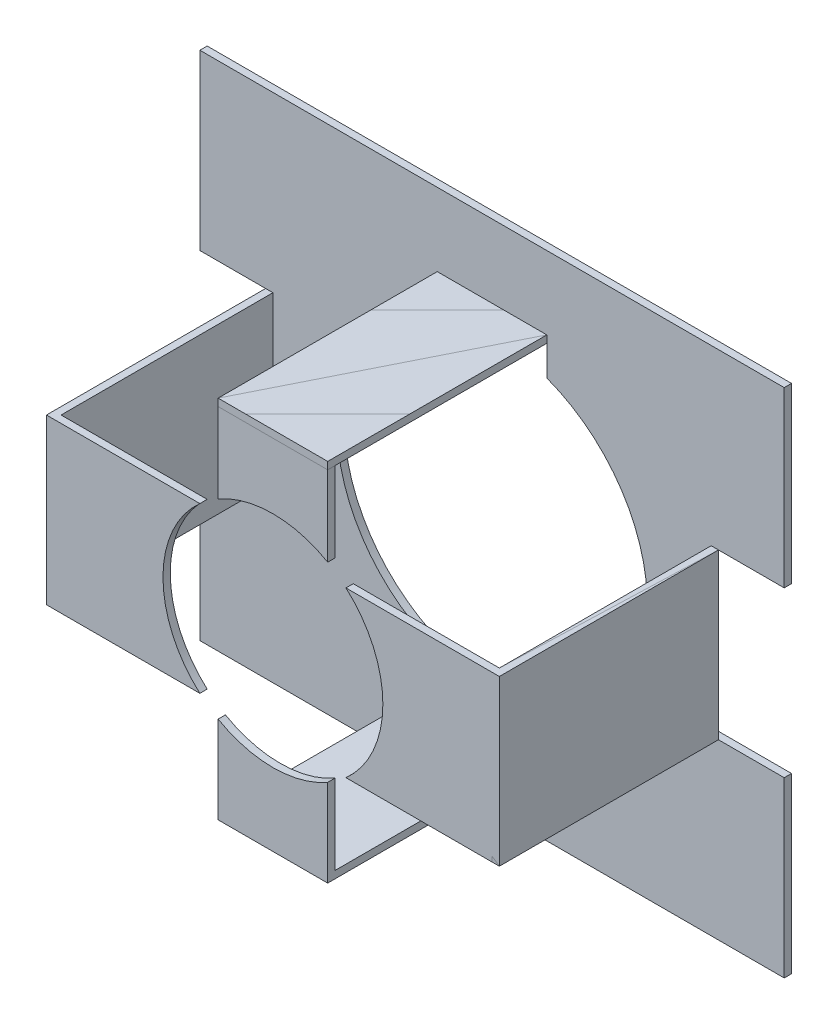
ISO-10303-21;
HEADER;
FILE_DESCRIPTION(('STEP AP214'),'2;1');
FILE_NAME('part.step','',(''),(''),'','','');
FILE_SCHEMA(('AUTOMOTIVE_DESIGN { 1 0 10303 214 1 1 1 1 }'));
ENDSEC;
DATA;
#1=APPLICATION_CONTEXT('core data for automotive mechanical design processes');
#2=APPLICATION_PROTOCOL_DEFINITION('international standard','automotive_design',2000,#1);
#3=PRODUCT_CONTEXT('',#1,'mechanical');
#4=PRODUCT('Part','Part','',(#3));
#5=PRODUCT_RELATED_PRODUCT_CATEGORY('part','',(#4));
#6=PRODUCT_DEFINITION_FORMATION('','',#4);
#7=PRODUCT_DEFINITION_CONTEXT('part definition',#1,'design');
#8=PRODUCT_DEFINITION('design','',#6,#7);
#9=PRODUCT_DEFINITION_SHAPE('','',#8);
#10=(LENGTH_UNIT() NAMED_UNIT(*) SI_UNIT(.MILLI.,.METRE.));
#11=(NAMED_UNIT(*) PLANE_ANGLE_UNIT() SI_UNIT($,.RADIAN.));
#12=(NAMED_UNIT(*) SI_UNIT($,.STERADIAN.) SOLID_ANGLE_UNIT());
#13=UNCERTAINTY_MEASURE_WITH_UNIT(LENGTH_MEASURE(1.E-05),#10,'distance_accuracy_value','');
#14=(GEOMETRIC_REPRESENTATION_CONTEXT(3) GLOBAL_UNCERTAINTY_ASSIGNED_CONTEXT((#13)) GLOBAL_UNIT_ASSIGNED_CONTEXT((#10,
#11,#12)) REPRESENTATION_CONTEXT('',''));
#15=CARTESIAN_POINT('',(0.,0.,0.));
#16=DIRECTION('',(0.,0.,1.));
#17=DIRECTION('',(1.,0.,0.));
#18=AXIS2_PLACEMENT_3D('',#15,#16,#17);
#19=CARTESIAN_POINT('',(-1.5,4.8,6.2));
#20=DIRECTION('',(0.,1.,0.));
#21=DIRECTION('',(0.,0.,-1.));
#22=AXIS2_PLACEMENT_3D('',#19,#20,#21);
#23=PLANE('',#22);
#24=DIRECTION('',(-1.,0.,0.));
#25=VECTOR('',#24,1.);
#26=CARTESIAN_POINT('',(1.5,4.8,6.00000000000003));
#27=LINE('',#26,#25);
#28=CARTESIAN_POINT('',(1.5,4.8,6.00000000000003));
#29=VERTEX_POINT('',#28);
#30=CARTESIAN_POINT('',(-1.5,4.8,6.));
#31=VERTEX_POINT('',#30);
#32=EDGE_CURVE('E98',#29,#31,#27,.T.);
#33=ORIENTED_EDGE('',*,*,#32,.T.);
#34=DIRECTION('',(0.,0.,-1.));
#35=VECTOR('',#34,1.);
#36=CARTESIAN_POINT('',(-1.5,4.8,6.2));
#37=LINE('',#36,#35);
#38=CARTESIAN_POINT('',(-1.5,4.8,0.199999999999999));
#39=VERTEX_POINT('',#38);
#40=EDGE_CURVE('E121',#31,#39,#37,.T.);
#41=ORIENTED_EDGE('',*,*,#40,.T.);
#42=DIRECTION('',(-1.,0.,0.));
#43=VECTOR('',#42,1.);
#44=CARTESIAN_POINT('',(-1.5,4.8,0.199999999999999));
#45=LINE('',#44,#43);
#46=CARTESIAN_POINT('',(1.5,4.8,0.199999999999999));
#47=VERTEX_POINT('',#46);
#48=EDGE_CURVE('E145',#47,#39,#45,.T.);
#49=ORIENTED_EDGE('',*,*,#48,.F.);
#50=DIRECTION('',(0.,0.,-1.));
#51=VECTOR('',#50,1.);
#52=CARTESIAN_POINT('',(1.5,4.8,6.20000000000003));
#53=LINE('',#52,#51);
#54=EDGE_CURVE('E129',#29,#47,#53,.T.);
#55=ORIENTED_EDGE('',*,*,#54,.F.);
#56=EDGE_LOOP('',(#33,#41,#49,#55));
#57=FACE_BOUND('',#56,.T.);
#58=ADVANCED_FACE('F42',(#57),#23,.F.);
#59=CARTESIAN_POINT('',(-1.5,5.,6.2));
#60=DIRECTION('',(0.,-1.,0.));
#61=DIRECTION('',(0.,0.,1.));
#62=AXIS2_PLACEMENT_3D('',#59,#60,#61);
#63=PLANE('',#62);
#64=DIRECTION('',(1.,0.,0.));
#65=VECTOR('',#64,1.);
#66=CARTESIAN_POINT('',(-1.5,5.,0.199999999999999));
#67=LINE('',#66,#65);
#68=CARTESIAN_POINT('',(-1.5,5.,0.199999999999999));
#69=VERTEX_POINT('',#68);
#70=CARTESIAN_POINT('',(1.5,5.,0.199999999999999));
#71=VERTEX_POINT('',#70);
#72=EDGE_CURVE('E140',#69,#71,#67,.T.);
#73=ORIENTED_EDGE('',*,*,#72,.F.);
#74=DIRECTION('',(0.,0.,-1.));
#75=VECTOR('',#74,1.);
#76=CARTESIAN_POINT('',(-1.5,5.,6.2));
#77=LINE('',#76,#75);
#78=CARTESIAN_POINT('',(-1.5,5.,6.2));
#79=VERTEX_POINT('',#78);
#80=EDGE_CURVE('E113',#79,#69,#77,.T.);
#81=ORIENTED_EDGE('',*,*,#80,.F.);
#82=DIRECTION('',(1.,0.,0.));
#83=VECTOR('',#82,1.);
#84=CARTESIAN_POINT('',(-1.5,5.,6.2));
#85=LINE('',#84,#83);
#86=CARTESIAN_POINT('',(1.5,5.,6.2));
#87=VERTEX_POINT('',#86);
#88=EDGE_CURVE('E111',#79,#87,#85,.T.);
#89=ORIENTED_EDGE('',*,*,#88,.T.);
#90=DIRECTION('',(0.,0.,-1.));
#91=VECTOR('',#90,1.);
#92=CARTESIAN_POINT('',(1.5,5.,6.2));
#93=LINE('',#92,#91);
#94=EDGE_CURVE('E50',#87,#71,#93,.T.);
#95=ORIENTED_EDGE('',*,*,#94,.T.);
#96=EDGE_LOOP('',(#73,#81,#89,#95));
#97=FACE_BOUND('',#96,.T.);
#98=ADVANCED_FACE('F44',(#97),#63,.F.);
#99=CARTESIAN_POINT('',(1.5,5.,6.2));
#100=DIRECTION('',(-1.,0.,0.));
#101=DIRECTION('',(0.,0.,1.));
#102=AXIS2_PLACEMENT_3D('',#99,#100,#101);
#103=PLANE('',#102);
#104=DIRECTION('',(0.,-1.,0.));
#105=VECTOR('',#104,1.);
#106=CARTESIAN_POINT('',(1.5,5.,6.2));
#107=LINE('',#106,#105);
#108=CARTESIAN_POINT('',(1.5,2.61007662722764,6.2));
#109=VERTEX_POINT('',#108);
#110=EDGE_CURVE('E104',#87,#109,#107,.T.);
#111=ORIENTED_EDGE('',*,*,#110,.T.);
#112=DIRECTION('',(0.,0.,1.));
#113=VECTOR('',#112,1.);
#114=CARTESIAN_POINT('',(1.5,2.61007662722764,2.2));
#115=LINE('',#114,#113);
#116=CARTESIAN_POINT('',(1.5,2.61007662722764,6.));
#117=VERTEX_POINT('',#116);
#118=EDGE_CURVE('E93',#109,#117,#115,.F.);
#119=ORIENTED_EDGE('',*,*,#118,.T.);
#120=DIRECTION('',(0.,1.,0.));
#121=VECTOR('',#120,1.);
#122=CARTESIAN_POINT('',(1.5,0.800000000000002,6.00000000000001));
#123=LINE('',#122,#121);
#124=EDGE_CURVE('E64',#117,#29,#123,.T.);
#125=ORIENTED_EDGE('',*,*,#124,.T.);
#126=ORIENTED_EDGE('',*,*,#54,.T.);
#127=DIRECTION('',(0.,-1.,0.));
#128=VECTOR('',#127,1.);
#129=CARTESIAN_POINT('',(1.5,5.,0.199999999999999));
#130=LINE('',#129,#128);
#131=EDGE_CURVE('E143',#71,#47,#130,.T.);
#132=ORIENTED_EDGE('',*,*,#131,.F.);
#133=ORIENTED_EDGE('',*,*,#94,.F.);
#134=EDGE_LOOP('',(#111,#119,#125,#126,#132,#133));
#135=FACE_BOUND('',#134,.T.);
#136=ADVANCED_FACE('F108',(#135),#103,.F.);
#137=CARTESIAN_POINT('',(-1.5,5.,6.2));
#138=DIRECTION('',(1.,0.,0.));
#139=DIRECTION('',(0.,0.,-1.));
#140=AXIS2_PLACEMENT_3D('',#137,#138,#139);
#141=PLANE('',#140);
#142=DIRECTION('',(0.,1.,0.));
#143=VECTOR('',#142,1.);
#144=CARTESIAN_POINT('',(-1.5,0.800000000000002,6.));
#145=LINE('',#144,#143);
#146=CARTESIAN_POINT('',(-1.5,2.61007662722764,6.));
#147=VERTEX_POINT('',#146);
#148=EDGE_CURVE('E134',#147,#31,#145,.T.);
#149=ORIENTED_EDGE('',*,*,#148,.F.);
#150=DIRECTION('',(0.,0.,1.));
#151=VECTOR('',#150,1.);
#152=CARTESIAN_POINT('',(-1.5,2.61007662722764,2.2));
#153=LINE('',#152,#151);
#154=CARTESIAN_POINT('',(-1.5,2.61007662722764,6.2));
#155=VERTEX_POINT('',#154);
#156=EDGE_CURVE('E57',#147,#155,#153,.T.);
#157=ORIENTED_EDGE('',*,*,#156,.T.);
#158=DIRECTION('',(0.,1.,0.));
#159=VECTOR('',#158,1.);
#160=CARTESIAN_POINT('',(-1.5,5.,6.2));
#161=LINE('',#160,#159);
#162=EDGE_CURVE('E106',#155,#79,#161,.T.);
#163=ORIENTED_EDGE('',*,*,#162,.T.);
#164=ORIENTED_EDGE('',*,*,#80,.T.);
#165=DIRECTION('',(0.,1.,0.));
#166=VECTOR('',#165,1.);
#167=CARTESIAN_POINT('',(-1.5,5.,0.199999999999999));
#168=LINE('',#167,#166);
#169=EDGE_CURVE('E115',#39,#69,#168,.T.);
#170=ORIENTED_EDGE('',*,*,#169,.F.);
#171=ORIENTED_EDGE('',*,*,#40,.F.);
#172=EDGE_LOOP('',(#149,#157,#163,#164,#170,#171));
#173=FACE_BOUND('',#172,.T.);
#174=ADVANCED_FACE('F155',(#173),#141,.F.);
#175=CARTESIAN_POINT('',(1.5,5.,6.2));
#176=DIRECTION('',(0.,0.,1.));
#177=DIRECTION('',(1.,0.,0.));
#178=AXIS2_PLACEMENT_3D('',#175,#176,#177);
#179=PLANE('',#178);
#180=CARTESIAN_POINT('',(0.,0.,6.2));
#181=DIRECTION('',(0.,0.,1.));
#182=DIRECTION('',(1.,0.,0.));
#183=AXIS2_PLACEMENT_3D('',#180,#181,#182);
#184=CIRCLE('',#183,3.01039864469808);
#185=EDGE_CURVE('E96',#109,#155,#184,.T.);
#186=ORIENTED_EDGE('',*,*,#185,.F.);
#187=ORIENTED_EDGE('',*,*,#110,.F.);
#188=ORIENTED_EDGE('',*,*,#88,.F.);
#189=ORIENTED_EDGE('',*,*,#162,.F.);
#190=EDGE_LOOP('',(#186,#187,#188,#189));
#191=FACE_BOUND('',#190,.T.);
#192=ADVANCED_FACE('F102',(#191),#179,.T.);
#193=CARTESIAN_POINT('',(1.5,5.,0.199999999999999));
#194=DIRECTION('',(0.,0.,1.));
#195=DIRECTION('',(1.,0.,0.));
#196=AXIS2_PLACEMENT_3D('',#193,#194,#195);
#197=PLANE('',#196);
#198=ORIENTED_EDGE('',*,*,#72,.T.);
#199=ORIENTED_EDGE('',*,*,#131,.T.);
#200=ORIENTED_EDGE('',*,*,#48,.T.);
#201=ORIENTED_EDGE('',*,*,#169,.T.);
#202=EDGE_LOOP('',(#198,#199,#200,#201));
#203=FACE_BOUND('',#202,.T.);
#204=ADVANCED_FACE('F148',(#203),#197,.F.);
#205=CARTESIAN_POINT('',(1.5,0.800000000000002,6.00000000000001));
#206=DIRECTION('',(0.,0.,1.));
#207=DIRECTION('',(1.,0.,0.));
#208=AXIS2_PLACEMENT_3D('',#205,#206,#207);
#209=PLANE('',#208);
#210=ORIENTED_EDGE('',*,*,#124,.F.);
#211=CARTESIAN_POINT('',(0.,0.,6.));
#212=DIRECTION('',(0.,0.,1.));
#213=DIRECTION('',(1.,0.,0.));
#214=AXIS2_PLACEMENT_3D('',#211,#212,#213);
#215=CIRCLE('',#214,3.01039864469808);
#216=EDGE_CURVE('E12',#117,#147,#215,.T.);
#217=ORIENTED_EDGE('',*,*,#216,.T.);
#218=ORIENTED_EDGE('',*,*,#148,.T.);
#219=ORIENTED_EDGE('',*,*,#32,.F.);
#220=EDGE_LOOP('',(#210,#217,#218,#219));
#221=FACE_BOUND('',#220,.T.);
#222=ADVANCED_FACE('F173',(#221),#209,.F.);
#223=CARTESIAN_POINT('',(0.,0.,2.2));
#224=DIRECTION('',(0.,0.,1.));
#225=DIRECTION('',(1.,0.,0.));
#226=AXIS2_PLACEMENT_3D('',#223,#224,#225);
#227=CYLINDRICAL_SURFACE('',#226,3.01039864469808);
#228=ORIENTED_EDGE('',*,*,#185,.T.);
#229=ORIENTED_EDGE('',*,*,#156,.F.);
#230=ORIENTED_EDGE('',*,*,#216,.F.);
#231=ORIENTED_EDGE('',*,*,#118,.F.);
#232=EDGE_LOOP('',(#228,#229,#230,#231));
#233=FACE_BOUND('',#232,.T.);
#234=ADVANCED_FACE('F95',(#233),#227,.F.);
#235=CLOSED_SHELL('',(#58,#98,#136,#174,#192,#204,#222,#234));
#236=MANIFOLD_SOLID_BREP('B2',#235);
#237=CARTESIAN_POINT('',(6.,2.25,6.2));
#238=DIRECTION('',(1.,0.,0.));
#239=DIRECTION('',(0.,0.,1.));
#240=AXIS2_PLACEMENT_3D('',#237,#238,#239);
#241=PLANE('',#240);
#242=DIRECTION('',(0.,1.,0.));
#243=VECTOR('',#242,1.);
#244=CARTESIAN_POINT('',(6.,2.25,6.));
#245=LINE('',#244,#243);
#246=CARTESIAN_POINT('',(6.,-2.25,6.));
#247=VERTEX_POINT('',#246);
#248=CARTESIAN_POINT('',(6.,2.25,6.));
#249=VERTEX_POINT('',#248);
#250=EDGE_CURVE('E293',#247,#249,#245,.T.);
#251=ORIENTED_EDGE('',*,*,#250,.T.);
#252=DIRECTION('',(0.,0.,-1.));
#253=VECTOR('',#252,1.);
#254=CARTESIAN_POINT('',(6.,2.25,6.2));
#255=LINE('',#254,#253);
#256=CARTESIAN_POINT('',(6.,2.25,0.200000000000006));
#257=VERTEX_POINT('',#256);
#258=EDGE_CURVE('E40',#249,#257,#255,.T.);
#259=ORIENTED_EDGE('',*,*,#258,.T.);
#260=DIRECTION('',(0.,1.,0.));
#261=VECTOR('',#260,1.);
#262=CARTESIAN_POINT('',(6.,2.25,0.200000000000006));
#263=LINE('',#262,#261);
#264=CARTESIAN_POINT('',(6.,-2.25,0.199999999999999));
#265=VERTEX_POINT('',#264);
#266=EDGE_CURVE('E325',#265,#257,#263,.T.);
#267=ORIENTED_EDGE('',*,*,#266,.F.);
#268=DIRECTION('',(0.,0.,-1.));
#269=VECTOR('',#268,1.);
#270=CARTESIAN_POINT('',(6.,-2.25,6.2));
#271=LINE('',#270,#269);
#272=EDGE_CURVE('E304',#247,#265,#271,.T.);
#273=ORIENTED_EDGE('',*,*,#272,.F.);
#274=EDGE_LOOP('',(#251,#259,#267,#273));
#275=FACE_BOUND('',#274,.T.);
#276=ADVANCED_FACE('F231',(#275),#241,.F.);
#277=CARTESIAN_POINT('',(6.,2.25,6.2));
#278=DIRECTION('',(0.,-1.,0.));
#279=DIRECTION('',(0.,0.,-1.));
#280=AXIS2_PLACEMENT_3D('',#277,#278,#279);
#281=PLANE('',#280);
#282=DIRECTION('',(1.,0.,0.));
#283=VECTOR('',#282,1.);
#284=CARTESIAN_POINT('',(6.,2.25,0.200000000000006));
#285=LINE('',#284,#283);
#286=CARTESIAN_POINT('',(6.2,2.25,0.200000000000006));
#287=VERTEX_POINT('',#286);
#288=EDGE_CURVE('E328',#257,#287,#285,.T.);
#289=ORIENTED_EDGE('',*,*,#288,.F.);
#290=ORIENTED_EDGE('',*,*,#258,.F.);
#291=DIRECTION('',(1.,0.,0.));
#292=VECTOR('',#291,1.);
#293=CARTESIAN_POINT('',(2.,2.25,5.99999999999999));
#294=LINE('',#293,#292);
#295=CARTESIAN_POINT('',(2.,2.25,5.99999999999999));
#296=VERTEX_POINT('',#295);
#297=EDGE_CURVE('E319',#296,#249,#294,.T.);
#298=ORIENTED_EDGE('',*,*,#297,.F.);
#299=DIRECTION('',(0.,0.,1.));
#300=VECTOR('',#299,1.);
#301=CARTESIAN_POINT('',(2.,2.25,6.2));
#302=LINE('',#301,#300);
#303=CARTESIAN_POINT('',(2.,2.25,6.2));
#304=VERTEX_POINT('',#303);
#305=EDGE_CURVE('E292',#296,#304,#302,.T.);
#306=ORIENTED_EDGE('',*,*,#305,.T.);
#307=DIRECTION('',(1.,0.,0.));
#308=VECTOR('',#307,1.);
#309=CARTESIAN_POINT('',(6.,2.25,6.2));
#310=LINE('',#309,#308);
#311=CARTESIAN_POINT('',(6.2,2.25,6.2));
#312=VERTEX_POINT('',#311);
#313=EDGE_CURVE('E297',#304,#312,#310,.T.);
#314=ORIENTED_EDGE('',*,*,#313,.T.);
#315=DIRECTION('',(0.,0.,-1.));
#316=VECTOR('',#315,1.);
#317=CARTESIAN_POINT('',(6.2,2.25,6.2));
#318=LINE('',#317,#316);
#319=EDGE_CURVE('E239',#312,#287,#318,.T.);
#320=ORIENTED_EDGE('',*,*,#319,.T.);
#321=EDGE_LOOP('',(#289,#290,#298,#306,#314,#320));
#322=FACE_BOUND('',#321,.T.);
#323=ADVANCED_FACE('F337',(#322),#281,.F.);
#324=CARTESIAN_POINT('',(6.2,2.25,6.2));
#325=DIRECTION('',(-1.,0.,0.));
#326=DIRECTION('',(0.,1.,0.));
#327=AXIS2_PLACEMENT_3D('',#324,#325,#326);
#328=PLANE('',#327);
#329=DIRECTION('',(0.,-1.,0.));
#330=VECTOR('',#329,1.);
#331=CARTESIAN_POINT('',(6.2,2.25,0.200000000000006));
#332=LINE('',#331,#330);
#333=CARTESIAN_POINT('',(6.2,-2.25,0.199999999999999));
#334=VERTEX_POINT('',#333);
#335=EDGE_CURVE('E331',#287,#334,#332,.T.);
#336=ORIENTED_EDGE('',*,*,#335,.F.);
#337=ORIENTED_EDGE('',*,*,#319,.F.);
#338=DIRECTION('',(0.,-1.,0.));
#339=VECTOR('',#338,1.);
#340=CARTESIAN_POINT('',(6.2,2.25,6.2));
#341=LINE('',#340,#339);
#342=CARTESIAN_POINT('',(6.2,-2.25,6.2));
#343=VERTEX_POINT('',#342);
#344=EDGE_CURVE('E305',#312,#343,#341,.T.);
#345=ORIENTED_EDGE('',*,*,#344,.T.);
#346=DIRECTION('',(0.,0.,-1.));
#347=VECTOR('',#346,1.);
#348=CARTESIAN_POINT('',(6.2,-2.25,6.2));
#349=LINE('',#348,#347);
#350=EDGE_CURVE('E302',#343,#334,#349,.T.);
#351=ORIENTED_EDGE('',*,*,#350,.T.);
#352=EDGE_LOOP('',(#336,#337,#345,#351));
#353=FACE_BOUND('',#352,.T.);
#354=ADVANCED_FACE('F349',(#353),#328,.F.);
#355=CARTESIAN_POINT('',(6.,-2.25,6.2));
#356=DIRECTION('',(0.,1.,0.));
#357=DIRECTION('',(0.,0.,1.));
#358=AXIS2_PLACEMENT_3D('',#355,#356,#357);
#359=PLANE('',#358);
#360=DIRECTION('',(-1.,0.,0.));
#361=VECTOR('',#360,1.);
#362=CARTESIAN_POINT('',(6.,-2.25,0.199999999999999));
#363=LINE('',#362,#361);
#364=EDGE_CURVE('E334',#334,#265,#363,.T.);
#365=ORIENTED_EDGE('',*,*,#364,.F.);
#366=ORIENTED_EDGE('',*,*,#350,.F.);
#367=DIRECTION('',(-1.,0.,0.));
#368=VECTOR('',#367,1.);
#369=CARTESIAN_POINT('',(6.,-2.25,6.2));
#370=LINE('',#369,#368);
#371=CARTESIAN_POINT('',(2.,-2.25,6.2));
#372=VERTEX_POINT('',#371);
#373=EDGE_CURVE('E255',#343,#372,#370,.T.);
#374=ORIENTED_EDGE('',*,*,#373,.T.);
#375=DIRECTION('',(0.,0.,-1.));
#376=VECTOR('',#375,1.);
#377=CARTESIAN_POINT('',(2.,-2.25,6.2));
#378=LINE('',#377,#376);
#379=CARTESIAN_POINT('',(2.,-2.25,6.));
#380=VERTEX_POINT('',#379);
#381=EDGE_CURVE('E286',#372,#380,#378,.T.);
#382=ORIENTED_EDGE('',*,*,#381,.T.);
#383=DIRECTION('',(1.,0.,0.));
#384=VECTOR('',#383,1.);
#385=CARTESIAN_POINT('',(2.,-2.25,6.));
#386=LINE('',#385,#384);
#387=EDGE_CURVE('E247',#380,#247,#386,.T.);
#388=ORIENTED_EDGE('',*,*,#387,.T.);
#389=ORIENTED_EDGE('',*,*,#272,.T.);
#390=EDGE_LOOP('',(#365,#366,#374,#382,#388,#389));
#391=FACE_BOUND('',#390,.T.);
#392=ADVANCED_FACE('F300',(#391),#359,.F.);
#393=CARTESIAN_POINT('',(6.,-2.25,6.2));
#394=DIRECTION('',(0.,0.,-1.));
#395=DIRECTION('',(1.,0.,0.));
#396=AXIS2_PLACEMENT_3D('',#393,#394,#395);
#397=PLANE('',#396);
#398=ORIENTED_EDGE('',*,*,#313,.F.);
#399=CARTESIAN_POINT('',(0.,0.,6.2));
#400=DIRECTION('',(0.,0.,1.));
#401=DIRECTION('',(1.,0.,0.));
#402=AXIS2_PLACEMENT_3D('',#399,#400,#401);
#403=CIRCLE('',#402,3.01039864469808);
#404=EDGE_CURVE('E288',#372,#304,#403,.T.);
#405=ORIENTED_EDGE('',*,*,#404,.F.);
#406=ORIENTED_EDGE('',*,*,#373,.F.);
#407=ORIENTED_EDGE('',*,*,#344,.F.);
#408=EDGE_LOOP('',(#398,#405,#406,#407));
#409=FACE_BOUND('',#408,.T.);
#410=ADVANCED_FACE('F295',(#409),#397,.F.);
#411=CARTESIAN_POINT('',(6.,-2.25,0.199999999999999));
#412=DIRECTION('',(0.,0.,-1.));
#413=DIRECTION('',(1.,0.,0.));
#414=AXIS2_PLACEMENT_3D('',#411,#412,#413);
#415=PLANE('',#414);
#416=ORIENTED_EDGE('',*,*,#266,.T.);
#417=ORIENTED_EDGE('',*,*,#288,.T.);
#418=ORIENTED_EDGE('',*,*,#335,.T.);
#419=ORIENTED_EDGE('',*,*,#364,.T.);
#420=EDGE_LOOP('',(#416,#417,#418,#419));
#421=FACE_BOUND('',#420,.T.);
#422=ADVANCED_FACE('F350',(#421),#415,.T.);
#423=CARTESIAN_POINT('',(2.,2.25,5.99999999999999));
#424=DIRECTION('',(0.,0.,1.));
#425=DIRECTION('',(0.,-1.,0.));
#426=AXIS2_PLACEMENT_3D('',#423,#424,#425);
#427=PLANE('',#426);
#428=ORIENTED_EDGE('',*,*,#387,.F.);
#429=CARTESIAN_POINT('',(0.,0.,6.));
#430=DIRECTION('',(0.,0.,1.));
#431=DIRECTION('',(0.,-1.,0.));
#432=AXIS2_PLACEMENT_3D('',#429,#430,#431);
#433=CIRCLE('',#432,3.01039864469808);
#434=EDGE_CURVE('E291',#380,#296,#433,.T.);
#435=ORIENTED_EDGE('',*,*,#434,.T.);
#436=ORIENTED_EDGE('',*,*,#297,.T.);
#437=ORIENTED_EDGE('',*,*,#250,.F.);
#438=EDGE_LOOP('',(#428,#435,#436,#437));
#439=FACE_BOUND('',#438,.T.);
#440=ADVANCED_FACE('F342',(#439),#427,.F.);
#441=CARTESIAN_POINT('',(0.,0.,2.2));
#442=DIRECTION('',(0.,0.,1.));
#443=DIRECTION('',(1.,0.,0.));
#444=AXIS2_PLACEMENT_3D('',#441,#442,#443);
#445=CYLINDRICAL_SURFACE('',#444,3.01039864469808);
#446=ORIENTED_EDGE('',*,*,#404,.T.);
#447=ORIENTED_EDGE('',*,*,#305,.F.);
#448=ORIENTED_EDGE('',*,*,#434,.F.);
#449=ORIENTED_EDGE('',*,*,#381,.F.);
#450=EDGE_LOOP('',(#446,#447,#448,#449));
#451=FACE_BOUND('',#450,.T.);
#452=ADVANCED_FACE('F287',(#451),#445,.F.);
#453=CLOSED_SHELL('',(#276,#323,#354,#392,#410,#422,#440,#452));
#454=MANIFOLD_SOLID_BREP('B6',#453);
#455=CARTESIAN_POINT('',(-1.5,-4.8,6.2));
#456=DIRECTION('',(0.,-1.,0.));
#457=DIRECTION('',(0.,0.,-1.));
#458=AXIS2_PLACEMENT_3D('',#455,#456,#457);
#459=PLANE('',#458);
#460=DIRECTION('',(-1.,0.,0.));
#461=VECTOR('',#460,1.);
#462=CARTESIAN_POINT('',(1.5,-4.8,6.));
#463=LINE('',#462,#461);
#464=CARTESIAN_POINT('',(1.5,-4.8,6.));
#465=VERTEX_POINT('',#464);
#466=CARTESIAN_POINT('',(-1.5,-4.8,6.));
#467=VERTEX_POINT('',#466);
#468=EDGE_CURVE('E506',#465,#467,#463,.T.);
#469=ORIENTED_EDGE('',*,*,#468,.F.);
#470=DIRECTION('',(0.,0.,-1.));
#471=VECTOR('',#470,1.);
#472=CARTESIAN_POINT('',(1.5,-4.8,6.2));
#473=LINE('',#472,#471);
#474=CARTESIAN_POINT('',(1.5,-4.8,0.199999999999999));
#475=VERTEX_POINT('',#474);
#476=EDGE_CURVE('E504',#465,#475,#473,.T.);
#477=ORIENTED_EDGE('',*,*,#476,.T.);
#478=DIRECTION('',(-1.,0.,0.));
#479=VECTOR('',#478,1.);
#480=CARTESIAN_POINT('',(-1.5,-4.8,0.199999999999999));
#481=LINE('',#480,#479);
#482=CARTESIAN_POINT('',(-1.5,-4.8,0.199999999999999));
#483=VERTEX_POINT('',#482);
#484=EDGE_CURVE('E521',#475,#483,#481,.T.);
#485=ORIENTED_EDGE('',*,*,#484,.T.);
#486=DIRECTION('',(0.,0.,-1.));
#487=VECTOR('',#486,1.);
#488=CARTESIAN_POINT('',(-1.5,-4.8,6.2));
#489=LINE('',#488,#487);
#490=EDGE_CURVE('E492',#467,#483,#489,.T.);
#491=ORIENTED_EDGE('',*,*,#490,.F.);
#492=EDGE_LOOP('',(#469,#477,#485,#491));
#493=FACE_BOUND('',#492,.T.);
#494=ADVANCED_FACE('F420',(#493),#459,.F.);
#495=CARTESIAN_POINT('',(-1.5,-5.,6.2));
#496=DIRECTION('',(0.,1.,0.));
#497=DIRECTION('',(0.,0.,1.));
#498=AXIS2_PLACEMENT_3D('',#495,#496,#497);
#499=PLANE('',#498);
#500=DIRECTION('',(1.,0.,0.));
#501=VECTOR('',#500,1.);
#502=CARTESIAN_POINT('',(-1.5,-5.,0.199999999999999));
#503=LINE('',#502,#501);
#504=CARTESIAN_POINT('',(-1.5,-5.,0.199999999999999));
#505=VERTEX_POINT('',#504);
#506=CARTESIAN_POINT('',(1.5,-5.,0.199999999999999));
#507=VERTEX_POINT('',#506);
#508=EDGE_CURVE('E515',#505,#507,#503,.T.);
#509=ORIENTED_EDGE('',*,*,#508,.T.);
#510=DIRECTION('',(0.,0.,-1.));
#511=VECTOR('',#510,1.);
#512=CARTESIAN_POINT('',(1.5,-5.,6.2));
#513=LINE('',#512,#511);
#514=CARTESIAN_POINT('',(1.5,-5.,6.2));
#515=VERTEX_POINT('',#514);
#516=EDGE_CURVE('E428',#515,#507,#513,.T.);
#517=ORIENTED_EDGE('',*,*,#516,.F.);
#518=DIRECTION('',(1.,0.,0.));
#519=VECTOR('',#518,1.);
#520=CARTESIAN_POINT('',(-1.5,-5.,6.2));
#521=LINE('',#520,#519);
#522=CARTESIAN_POINT('',(-1.5,-5.,6.2));
#523=VERTEX_POINT('',#522);
#524=EDGE_CURVE('E494',#523,#515,#521,.T.);
#525=ORIENTED_EDGE('',*,*,#524,.F.);
#526=DIRECTION('',(0.,0.,-1.));
#527=VECTOR('',#526,1.);
#528=CARTESIAN_POINT('',(-1.5,-5.,6.2));
#529=LINE('',#528,#527);
#530=EDGE_CURVE('E489',#523,#505,#529,.T.);
#531=ORIENTED_EDGE('',*,*,#530,.T.);
#532=EDGE_LOOP('',(#509,#517,#525,#531));
#533=FACE_BOUND('',#532,.T.);
#534=ADVANCED_FACE('F422',(#533),#499,.F.);
#535=CARTESIAN_POINT('',(1.5,-5.,6.2));
#536=DIRECTION('',(-1.,0.,0.));
#537=DIRECTION('',(0.,0.,1.));
#538=AXIS2_PLACEMENT_3D('',#535,#536,#537);
#539=PLANE('',#538);
#540=DIRECTION('',(0.,-1.,0.));
#541=VECTOR('',#540,1.);
#542=CARTESIAN_POINT('',(1.5,-0.800000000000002,6.));
#543=LINE('',#542,#541);
#544=CARTESIAN_POINT('',(1.5,-2.61007662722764,6.00000000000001));
#545=VERTEX_POINT('',#544);
#546=EDGE_CURVE('E441',#545,#465,#543,.T.);
#547=ORIENTED_EDGE('',*,*,#546,.F.);
#548=DIRECTION('',(0.,0.,1.));
#549=VECTOR('',#548,1.);
#550=CARTESIAN_POINT('',(1.5,-2.61007662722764,2.19999999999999));
#551=LINE('',#550,#549);
#552=CARTESIAN_POINT('',(1.5,-2.61007662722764,6.2));
#553=VERTEX_POINT('',#552);
#554=EDGE_CURVE('E435',#545,#553,#551,.T.);
#555=ORIENTED_EDGE('',*,*,#554,.T.);
#556=DIRECTION('',(0.,1.,0.));
#557=VECTOR('',#556,1.);
#558=CARTESIAN_POINT('',(1.5,-5.,6.2));
#559=LINE('',#558,#557);
#560=EDGE_CURVE('E485',#515,#553,#559,.T.);
#561=ORIENTED_EDGE('',*,*,#560,.F.);
#562=ORIENTED_EDGE('',*,*,#516,.T.);
#563=DIRECTION('',(0.,1.,0.));
#564=VECTOR('',#563,1.);
#565=CARTESIAN_POINT('',(1.5,-5.,0.199999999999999));
#566=LINE('',#565,#564);
#567=EDGE_CURVE('E518',#507,#475,#566,.T.);
#568=ORIENTED_EDGE('',*,*,#567,.T.);
#569=ORIENTED_EDGE('',*,*,#476,.F.);
#570=EDGE_LOOP('',(#547,#555,#561,#562,#568,#569));
#571=FACE_BOUND('',#570,.T.);
#572=ADVANCED_FACE('F530',(#571),#539,.F.);
#573=CARTESIAN_POINT('',(-1.5,-5.,6.2));
#574=DIRECTION('',(1.,0.,0.));
#575=DIRECTION('',(0.,0.,-1.));
#576=AXIS2_PLACEMENT_3D('',#573,#574,#575);
#577=PLANE('',#576);
#578=DIRECTION('',(0.,-1.,0.));
#579=VECTOR('',#578,1.);
#580=CARTESIAN_POINT('',(-1.5,-5.,6.2));
#581=LINE('',#580,#579);
#582=CARTESIAN_POINT('',(-1.5,-2.61007662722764,6.2));
#583=VERTEX_POINT('',#582);
#584=EDGE_CURVE('E483',#583,#523,#581,.T.);
#585=ORIENTED_EDGE('',*,*,#584,.F.);
#586=DIRECTION('',(0.,0.,1.));
#587=VECTOR('',#586,1.);
#588=CARTESIAN_POINT('',(-1.5,-2.61007662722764,2.19999999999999));
#589=LINE('',#588,#587);
#590=CARTESIAN_POINT('',(-1.5,-2.61007662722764,6.));
#591=VERTEX_POINT('',#590);
#592=EDGE_CURVE('E471',#583,#591,#589,.F.);
#593=ORIENTED_EDGE('',*,*,#592,.T.);
#594=DIRECTION('',(0.,-1.,0.));
#595=VECTOR('',#594,1.);
#596=CARTESIAN_POINT('',(-1.5,-0.800000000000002,6.));
#597=LINE('',#596,#595);
#598=EDGE_CURVE('E509',#591,#467,#597,.T.);
#599=ORIENTED_EDGE('',*,*,#598,.T.);
#600=ORIENTED_EDGE('',*,*,#490,.T.);
#601=DIRECTION('',(0.,-1.,0.));
#602=VECTOR('',#601,1.);
#603=CARTESIAN_POINT('',(-1.5,-5.,0.199999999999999));
#604=LINE('',#603,#602);
#605=EDGE_CURVE('E524',#483,#505,#604,.T.);
#606=ORIENTED_EDGE('',*,*,#605,.T.);
#607=ORIENTED_EDGE('',*,*,#530,.F.);
#608=EDGE_LOOP('',(#585,#593,#599,#600,#606,#607));
#609=FACE_BOUND('',#608,.T.);
#610=ADVANCED_FACE('F487',(#609),#577,.F.);
#611=CARTESIAN_POINT('',(1.5,-5.,6.2));
#612=DIRECTION('',(0.,0.,1.));
#613=DIRECTION('',(1.,0.,0.));
#614=AXIS2_PLACEMENT_3D('',#611,#612,#613);
#615=PLANE('',#614);
#616=CARTESIAN_POINT('',(0.,0.,6.2));
#617=DIRECTION('',(0.,0.,1.));
#618=DIRECTION('',(1.,0.,0.));
#619=AXIS2_PLACEMENT_3D('',#616,#617,#618);
#620=CIRCLE('',#619,3.01039864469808);
#621=EDGE_CURVE('E474',#583,#553,#620,.T.);
#622=ORIENTED_EDGE('',*,*,#621,.F.);
#623=ORIENTED_EDGE('',*,*,#584,.T.);
#624=ORIENTED_EDGE('',*,*,#524,.T.);
#625=ORIENTED_EDGE('',*,*,#560,.T.);
#626=EDGE_LOOP('',(#622,#623,#624,#625));
#627=FACE_BOUND('',#626,.T.);
#628=ADVANCED_FACE('F481',(#627),#615,.T.);
#629=CARTESIAN_POINT('',(1.5,-5.,0.199999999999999));
#630=DIRECTION('',(0.,0.,1.));
#631=DIRECTION('',(1.,0.,0.));
#632=AXIS2_PLACEMENT_3D('',#629,#630,#631);
#633=PLANE('',#632);
#634=ORIENTED_EDGE('',*,*,#508,.F.);
#635=ORIENTED_EDGE('',*,*,#605,.F.);
#636=ORIENTED_EDGE('',*,*,#484,.F.);
#637=ORIENTED_EDGE('',*,*,#567,.F.);
#638=EDGE_LOOP('',(#634,#635,#636,#637));
#639=FACE_BOUND('',#638,.T.);
#640=ADVANCED_FACE('F540',(#639),#633,.F.);
#641=CARTESIAN_POINT('',(1.5,-0.800000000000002,6.));
#642=DIRECTION('',(0.,0.,1.));
#643=DIRECTION('',(1.,0.,0.));
#644=AXIS2_PLACEMENT_3D('',#641,#642,#643);
#645=PLANE('',#644);
#646=ORIENTED_EDGE('',*,*,#598,.F.);
#647=CARTESIAN_POINT('',(0.,0.,6.));
#648=DIRECTION('',(0.,0.,1.));
#649=DIRECTION('',(1.,0.,0.));
#650=AXIS2_PLACEMENT_3D('',#647,#648,#649);
#651=CIRCLE('',#650,3.01039864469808);
#652=EDGE_CURVE('E229',#591,#545,#651,.T.);
#653=ORIENTED_EDGE('',*,*,#652,.T.);
#654=ORIENTED_EDGE('',*,*,#546,.T.);
#655=ORIENTED_EDGE('',*,*,#468,.T.);
#656=EDGE_LOOP('',(#646,#653,#654,#655));
#657=FACE_BOUND('',#656,.T.);
#658=ADVANCED_FACE('F538',(#657),#645,.F.);
#659=CARTESIAN_POINT('',(0.,0.,2.2));
#660=DIRECTION('',(0.,0.,1.));
#661=DIRECTION('',(1.,0.,0.));
#662=AXIS2_PLACEMENT_3D('',#659,#660,#661);
#663=CYLINDRICAL_SURFACE('',#662,3.01039864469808);
#664=ORIENTED_EDGE('',*,*,#652,.F.);
#665=ORIENTED_EDGE('',*,*,#592,.F.);
#666=ORIENTED_EDGE('',*,*,#621,.T.);
#667=ORIENTED_EDGE('',*,*,#554,.F.);
#668=EDGE_LOOP('',(#664,#665,#666,#667));
#669=FACE_BOUND('',#668,.T.);
#670=ADVANCED_FACE('F473',(#669),#663,.F.);
#671=CLOSED_SHELL('',(#494,#534,#572,#610,#628,#640,#658,#670));
#672=MANIFOLD_SOLID_BREP('B34',#671);
#673=CARTESIAN_POINT('',(6.,2.25,6.2));
#674=DIRECTION('',(0.,-1.,0.));
#675=DIRECTION('',(0.,0.,-1.));
#676=AXIS2_PLACEMENT_3D('',#673,#674,#675);
#677=PLANE('',#676);
#678=DIRECTION('',(-1.,0.,0.));
#679=VECTOR('',#678,1.);
#680=CARTESIAN_POINT('',(6.,2.25,0.200000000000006));
#681=LINE('',#680,#679);
#682=CARTESIAN_POINT('',(6.2,2.25,0.200000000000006));
#683=VERTEX_POINT('',#682);
#684=CARTESIAN_POINT('',(6.,2.25,0.200000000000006));
#685=VERTEX_POINT('',#684);
#686=EDGE_CURVE('E653',#683,#685,#681,.T.);
#687=ORIENTED_EDGE('',*,*,#686,.T.);
#688=DIRECTION('',(0.,0.,-1.));
#689=VECTOR('',#688,1.);
#690=CARTESIAN_POINT('',(6.,2.25,6.2));
#691=LINE('',#690,#689);
#692=CARTESIAN_POINT('',(6.,2.25,6.2));
#693=VERTEX_POINT('',#692);
#694=EDGE_CURVE('E418',#693,#685,#691,.T.);
#695=ORIENTED_EDGE('',*,*,#694,.F.);
#696=DIRECTION('',(-1.,0.,0.));
#697=VECTOR('',#696,1.);
#698=CARTESIAN_POINT('',(6.,2.25,6.2));
#699=LINE('',#698,#697);
#700=CARTESIAN_POINT('',(6.2,2.25,6.2));
#701=VERTEX_POINT('',#700);
#702=EDGE_CURVE('E671',#701,#693,#699,.T.);
#703=ORIENTED_EDGE('',*,*,#702,.F.);
#704=DIRECTION('',(0.,0.,-1.));
#705=VECTOR('',#704,1.);
#706=CARTESIAN_POINT('',(6.2,2.25,6.2));
#707=LINE('',#706,#705);
#708=EDGE_CURVE('E665',#701,#683,#707,.T.);
#709=ORIENTED_EDGE('',*,*,#708,.T.);
#710=EDGE_LOOP('',(#687,#695,#703,#709));
#711=FACE_BOUND('',#710,.T.);
#712=ADVANCED_FACE('F609',(#711),#677,.F.);
#713=CARTESIAN_POINT('',(6.,2.25,6.2));
#714=DIRECTION('',(1.,0.,0.));
#715=DIRECTION('',(0.,0.,-1.));
#716=AXIS2_PLACEMENT_3D('',#713,#714,#715);
#717=PLANE('',#716);
#718=DIRECTION('',(0.,-1.,0.));
#719=VECTOR('',#718,1.);
#720=CARTESIAN_POINT('',(6.,2.25,0.200000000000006));
#721=LINE('',#720,#719);
#722=CARTESIAN_POINT('',(6.,-2.25,0.199999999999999));
#723=VERTEX_POINT('',#722);
#724=EDGE_CURVE('E649',#685,#723,#721,.T.);
#725=ORIENTED_EDGE('',*,*,#724,.T.);
#726=DIRECTION('',(0.,0.,-1.));
#727=VECTOR('',#726,1.);
#728=CARTESIAN_POINT('',(6.,-2.25,6.2));
#729=LINE('',#728,#727);
#730=CARTESIAN_POINT('',(6.,-2.25,6.2));
#731=VERTEX_POINT('',#730);
#732=EDGE_CURVE('E616',#731,#723,#729,.T.);
#733=ORIENTED_EDGE('',*,*,#732,.F.);
#734=DIRECTION('',(0.,-1.,0.));
#735=VECTOR('',#734,1.);
#736=CARTESIAN_POINT('',(6.,2.25,6.2));
#737=LINE('',#736,#735);
#738=EDGE_CURVE('E661',#693,#731,#737,.T.);
#739=ORIENTED_EDGE('',*,*,#738,.F.);
#740=ORIENTED_EDGE('',*,*,#694,.T.);
#741=EDGE_LOOP('',(#725,#733,#739,#740));
#742=FACE_BOUND('',#741,.T.);
#743=ADVANCED_FACE('F660',(#742),#717,.F.);
#744=CARTESIAN_POINT('',(6.,-2.25,6.2));
#745=DIRECTION('',(0.,1.,0.));
#746=DIRECTION('',(0.,0.,1.));
#747=AXIS2_PLACEMENT_3D('',#744,#745,#746);
#748=PLANE('',#747);
#749=DIRECTION('',(1.,0.,0.));
#750=VECTOR('',#749,1.);
#751=CARTESIAN_POINT('',(6.,-2.25,0.199999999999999));
#752=LINE('',#751,#750);
#753=CARTESIAN_POINT('',(6.2,-2.25,0.199999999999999));
#754=VERTEX_POINT('',#753);
#755=EDGE_CURVE('E654',#723,#754,#752,.T.);
#756=ORIENTED_EDGE('',*,*,#755,.T.);
#757=DIRECTION('',(0.,0.,-1.));
#758=VECTOR('',#757,1.);
#759=CARTESIAN_POINT('',(6.2,-2.25,6.2));
#760=LINE('',#759,#758);
#761=CARTESIAN_POINT('',(6.2,-2.25,6.2));
#762=VERTEX_POINT('',#761);
#763=EDGE_CURVE('E677',#762,#754,#760,.T.);
#764=ORIENTED_EDGE('',*,*,#763,.F.);
#765=DIRECTION('',(1.,0.,0.));
#766=VECTOR('',#765,1.);
#767=CARTESIAN_POINT('',(6.,-2.25,6.2));
#768=LINE('',#767,#766);
#769=EDGE_CURVE('E628',#731,#762,#768,.T.);
#770=ORIENTED_EDGE('',*,*,#769,.F.);
#771=ORIENTED_EDGE('',*,*,#732,.T.);
#772=EDGE_LOOP('',(#756,#764,#770,#771));
#773=FACE_BOUND('',#772,.T.);
#774=ADVANCED_FACE('F680',(#773),#748,.F.);
#775=CARTESIAN_POINT('',(6.2,2.25,6.2));
#776=DIRECTION('',(-1.,0.,0.));
#777=DIRECTION('',(0.,-1.,0.));
#778=AXIS2_PLACEMENT_3D('',#775,#776,#777);
#779=PLANE('',#778);
#780=DIRECTION('',(0.,1.,0.));
#781=VECTOR('',#780,1.);
#782=CARTESIAN_POINT('',(6.2,2.25,0.200000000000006));
#783=LINE('',#782,#781);
#784=EDGE_CURVE('E669',#754,#683,#783,.T.);
#785=ORIENTED_EDGE('',*,*,#784,.T.);
#786=ORIENTED_EDGE('',*,*,#708,.F.);
#787=DIRECTION('',(0.,1.,0.));
#788=VECTOR('',#787,1.);
#789=CARTESIAN_POINT('',(6.2,2.25,6.2));
#790=LINE('',#789,#788);
#791=EDGE_CURVE('E623',#762,#701,#790,.T.);
#792=ORIENTED_EDGE('',*,*,#791,.F.);
#793=ORIENTED_EDGE('',*,*,#763,.T.);
#794=EDGE_LOOP('',(#785,#786,#792,#793));
#795=FACE_BOUND('',#794,.T.);
#796=ADVANCED_FACE('F682',(#795),#779,.F.);
#797=CARTESIAN_POINT('',(6.,2.25,6.2));
#798=DIRECTION('',(0.,0.,-1.));
#799=DIRECTION('',(-1.,0.,0.));
#800=AXIS2_PLACEMENT_3D('',#797,#798,#799);
#801=PLANE('',#800);
#802=ORIENTED_EDGE('',*,*,#702,.T.);
#803=ORIENTED_EDGE('',*,*,#738,.T.);
#804=ORIENTED_EDGE('',*,*,#769,.T.);
#805=ORIENTED_EDGE('',*,*,#791,.T.);
#806=EDGE_LOOP('',(#802,#803,#804,#805));
#807=FACE_BOUND('',#806,.T.);
#808=ADVANCED_FACE('F683',(#807),#801,.F.);
#809=CARTESIAN_POINT('',(6.,2.25,0.200000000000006));
#810=DIRECTION('',(0.,0.,-1.));
#811=DIRECTION('',(-1.,0.,0.));
#812=AXIS2_PLACEMENT_3D('',#809,#810,#811);
#813=PLANE('',#812);
#814=ORIENTED_EDGE('',*,*,#686,.F.);
#815=ORIENTED_EDGE('',*,*,#784,.F.);
#816=ORIENTED_EDGE('',*,*,#755,.F.);
#817=ORIENTED_EDGE('',*,*,#724,.F.);
#818=EDGE_LOOP('',(#814,#815,#816,#817));
#819=FACE_BOUND('',#818,.T.);
#820=ADVANCED_FACE('F650',(#819),#813,.T.);
#821=CLOSED_SHELL('',(#712,#743,#774,#796,#808,#820));
#822=MANIFOLD_SOLID_BREP('B223',#821);
#823=CARTESIAN_POINT('',(-1.5,5.,6.2));
#824=DIRECTION('',(1.,0.,0.));
#825=DIRECTION('',(0.,0.,-1.));
#826=AXIS2_PLACEMENT_3D('',#823,#824,#825);
#827=PLANE('',#826);
#828=DIRECTION('',(0.,-1.,0.));
#829=VECTOR('',#828,1.);
#830=CARTESIAN_POINT('',(-1.5,5.,0.199999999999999));
#831=LINE('',#830,#829);
#832=CARTESIAN_POINT('',(-1.5,5.,0.199999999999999));
#833=VERTEX_POINT('',#832);
#834=CARTESIAN_POINT('',(-1.5,4.8,0.199999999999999));
#835=VERTEX_POINT('',#834);
#836=EDGE_CURVE('E775',#833,#835,#831,.T.);
#837=ORIENTED_EDGE('',*,*,#836,.T.);
#838=DIRECTION('',(0.,0.,-1.));
#839=VECTOR('',#838,1.);
#840=CARTESIAN_POINT('',(-1.5,4.8,6.2));
#841=LINE('',#840,#839);
#842=CARTESIAN_POINT('',(-1.5,4.8,6.2));
#843=VERTEX_POINT('',#842);
#844=EDGE_CURVE('E607',#843,#835,#841,.T.);
#845=ORIENTED_EDGE('',*,*,#844,.F.);
#846=DIRECTION('',(0.,-1.,0.));
#847=VECTOR('',#846,1.);
#848=CARTESIAN_POINT('',(-1.5,5.,6.2));
#849=LINE('',#848,#847);
#850=CARTESIAN_POINT('',(-1.5,5.,6.2));
#851=VERTEX_POINT('',#850);
#852=EDGE_CURVE('E793',#851,#843,#849,.T.);
#853=ORIENTED_EDGE('',*,*,#852,.F.);
#854=DIRECTION('',(0.,0.,-1.));
#855=VECTOR('',#854,1.);
#856=CARTESIAN_POINT('',(-1.5,5.,6.2));
#857=LINE('',#856,#855);
#858=EDGE_CURVE('E787',#851,#833,#857,.T.);
#859=ORIENTED_EDGE('',*,*,#858,.T.);
#860=EDGE_LOOP('',(#837,#845,#853,#859));
#861=FACE_BOUND('',#860,.T.);
#862=ADVANCED_FACE('F731',(#861),#827,.F.);
#863=CARTESIAN_POINT('',(-1.5,4.8,6.2));
#864=DIRECTION('',(0.,1.,0.));
#865=DIRECTION('',(0.,0.,1.));
#866=AXIS2_PLACEMENT_3D('',#863,#864,#865);
#867=PLANE('',#866);
#868=DIRECTION('',(1.,0.,0.));
#869=VECTOR('',#868,1.);
#870=CARTESIAN_POINT('',(-1.5,4.8,0.199999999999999));
#871=LINE('',#870,#869);
#872=CARTESIAN_POINT('',(1.5,4.8,0.199999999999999));
#873=VERTEX_POINT('',#872);
#874=EDGE_CURVE('E771',#835,#873,#871,.T.);
#875=ORIENTED_EDGE('',*,*,#874,.T.);
#876=DIRECTION('',(0.,0.,-1.));
#877=VECTOR('',#876,1.);
#878=CARTESIAN_POINT('',(1.5,4.8,6.20000000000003));
#879=LINE('',#878,#877);
#880=CARTESIAN_POINT('',(1.5,4.8,6.20000000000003));
#881=VERTEX_POINT('',#880);
#882=EDGE_CURVE('E738',#881,#873,#879,.T.);
#883=ORIENTED_EDGE('',*,*,#882,.F.);
#884=DIRECTION('',(1.,0.,0.));
#885=VECTOR('',#884,1.);
#886=CARTESIAN_POINT('',(-1.5,4.8,6.2));
#887=LINE('',#886,#885);
#888=EDGE_CURVE('E783',#843,#881,#887,.T.);
#889=ORIENTED_EDGE('',*,*,#888,.F.);
#890=ORIENTED_EDGE('',*,*,#844,.T.);
#891=EDGE_LOOP('',(#875,#883,#889,#890));
#892=FACE_BOUND('',#891,.T.);
#893=ADVANCED_FACE('F782',(#892),#867,.F.);
#894=CARTESIAN_POINT('',(1.5,5.,6.2));
#895=DIRECTION('',(-1.,0.,0.));
#896=DIRECTION('',(0.,0.,1.));
#897=AXIS2_PLACEMENT_3D('',#894,#895,#896);
#898=PLANE('',#897);
#899=DIRECTION('',(0.,1.,0.));
#900=VECTOR('',#899,1.);
#901=CARTESIAN_POINT('',(1.5,5.,0.199999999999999));
#902=LINE('',#901,#900);
#903=CARTESIAN_POINT('',(1.5,5.,0.199999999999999));
#904=VERTEX_POINT('',#903);
#905=EDGE_CURVE('E776',#873,#904,#902,.T.);
#906=ORIENTED_EDGE('',*,*,#905,.T.);
#907=DIRECTION('',(0.,0.,-1.));
#908=VECTOR('',#907,1.);
#909=CARTESIAN_POINT('',(1.5,5.,6.2));
#910=LINE('',#909,#908);
#911=CARTESIAN_POINT('',(1.5,5.,6.2));
#912=VERTEX_POINT('',#911);
#913=EDGE_CURVE('E799',#912,#904,#910,.T.);
#914=ORIENTED_EDGE('',*,*,#913,.F.);
#915=DIRECTION('',(0.,1.,0.));
#916=VECTOR('',#915,1.);
#917=CARTESIAN_POINT('',(1.5,5.,6.2));
#918=LINE('',#917,#916);
#919=EDGE_CURVE('E750',#881,#912,#918,.T.);
#920=ORIENTED_EDGE('',*,*,#919,.F.);
#921=ORIENTED_EDGE('',*,*,#882,.T.);
#922=EDGE_LOOP('',(#906,#914,#920,#921));
#923=FACE_BOUND('',#922,.T.);
#924=ADVANCED_FACE('F802',(#923),#898,.F.);
#925=CARTESIAN_POINT('',(-1.5,5.,6.2));
#926=DIRECTION('',(0.,-1.,0.));
#927=DIRECTION('',(0.,0.,-1.));
#928=AXIS2_PLACEMENT_3D('',#925,#926,#927);
#929=PLANE('',#928);
#930=DIRECTION('',(-1.,0.,0.));
#931=VECTOR('',#930,1.);
#932=CARTESIAN_POINT('',(-1.5,5.,0.199999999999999));
#933=LINE('',#932,#931);
#934=EDGE_CURVE('E791',#904,#833,#933,.T.);
#935=ORIENTED_EDGE('',*,*,#934,.T.);
#936=ORIENTED_EDGE('',*,*,#858,.F.);
#937=DIRECTION('',(-1.,0.,0.));
#938=VECTOR('',#937,1.);
#939=CARTESIAN_POINT('',(-1.5,5.,6.2));
#940=LINE('',#939,#938);
#941=EDGE_CURVE('E745',#912,#851,#940,.T.);
#942=ORIENTED_EDGE('',*,*,#941,.F.);
#943=ORIENTED_EDGE('',*,*,#913,.T.);
#944=EDGE_LOOP('',(#935,#936,#942,#943));
#945=FACE_BOUND('',#944,.T.);
#946=ADVANCED_FACE('F804',(#945),#929,.F.);
#947=CARTESIAN_POINT('',(-1.5,4.8,6.2));
#948=DIRECTION('',(0.,0.,1.));
#949=DIRECTION('',(1.,0.,0.));
#950=AXIS2_PLACEMENT_3D('',#947,#948,#949);
#951=PLANE('',#950);
#952=ORIENTED_EDGE('',*,*,#852,.T.);
#953=ORIENTED_EDGE('',*,*,#888,.T.);
#954=ORIENTED_EDGE('',*,*,#919,.T.);
#955=ORIENTED_EDGE('',*,*,#941,.T.);
#956=EDGE_LOOP('',(#952,#953,#954,#955));
#957=FACE_BOUND('',#956,.T.);
#958=ADVANCED_FACE('F805',(#957),#951,.T.);
#959=CARTESIAN_POINT('',(-1.5,4.8,0.199999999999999));
#960=DIRECTION('',(0.,0.,1.));
#961=DIRECTION('',(1.,0.,0.));
#962=AXIS2_PLACEMENT_3D('',#959,#960,#961);
#963=PLANE('',#962);
#964=ORIENTED_EDGE('',*,*,#836,.F.);
#965=ORIENTED_EDGE('',*,*,#934,.F.);
#966=ORIENTED_EDGE('',*,*,#905,.F.);
#967=ORIENTED_EDGE('',*,*,#874,.F.);
#968=EDGE_LOOP('',(#964,#965,#966,#967));
#969=FACE_BOUND('',#968,.T.);
#970=ADVANCED_FACE('F772',(#969),#963,.F.);
#971=CLOSED_SHELL('',(#862,#893,#924,#946,#958,#970));
#972=MANIFOLD_SOLID_BREP('B412',#971);
#973=CARTESIAN_POINT('',(-6.,2.25,6.2));
#974=DIRECTION('',(-1.,0.,0.));
#975=DIRECTION('',(0.,0.,1.));
#976=AXIS2_PLACEMENT_3D('',#973,#974,#975);
#977=PLANE('',#976);
#978=DIRECTION('',(0.,1.,0.));
#979=VECTOR('',#978,1.);
#980=CARTESIAN_POINT('',(-6.,2.25000000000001,6.));
#981=LINE('',#980,#979);
#982=CARTESIAN_POINT('',(-6.,-2.25,6.));
#983=VERTEX_POINT('',#982);
#984=CARTESIAN_POINT('',(-6.,2.25000000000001,6.));
#985=VERTEX_POINT('',#984);
#986=EDGE_CURVE('E868',#983,#985,#981,.T.);
#987=ORIENTED_EDGE('',*,*,#986,.F.);
#988=DIRECTION('',(0.,0.,-1.));
#989=VECTOR('',#988,1.);
#990=CARTESIAN_POINT('',(-6.,-2.25,6.2));
#991=LINE('',#990,#989);
#992=CARTESIAN_POINT('',(-6.,-2.25,0.199999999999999));
#993=VERTEX_POINT('',#992);
#994=EDGE_CURVE('E936',#983,#993,#991,.T.);
#995=ORIENTED_EDGE('',*,*,#994,.T.);
#996=DIRECTION('',(0.,1.,0.));
#997=VECTOR('',#996,1.);
#998=CARTESIAN_POINT('',(-6.,2.25,0.200000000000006));
#999=LINE('',#998,#997);
#1000=CARTESIAN_POINT('',(-6.,2.25,0.200000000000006));
#1001=VERTEX_POINT('',#1000);
#1002=EDGE_CURVE('E951',#993,#1001,#999,.T.);
#1003=ORIENTED_EDGE('',*,*,#1002,.T.);
#1004=DIRECTION('',(0.,0.,-1.));
#1005=VECTOR('',#1004,1.);
#1006=CARTESIAN_POINT('',(-6.,2.25,6.2));
#1007=LINE('',#1006,#1005);
#1008=EDGE_CURVE('E729',#985,#1001,#1007,.T.);
#1009=ORIENTED_EDGE('',*,*,#1008,.F.);
#1010=EDGE_LOOP('',(#987,#995,#1003,#1009));
#1011=FACE_BOUND('',#1010,.T.);
#1012=ADVANCED_FACE('F852',(#1011),#977,.F.);
#1013=CARTESIAN_POINT('',(-6.,2.25,6.2));
#1014=DIRECTION('',(0.,-1.,0.));
#1015=DIRECTION('',(0.,0.,-1.));
#1016=AXIS2_PLACEMENT_3D('',#1013,#1014,#1015);
#1017=PLANE('',#1016);
#1018=DIRECTION('',(-1.,0.,0.));
#1019=VECTOR('',#1018,1.);
#1020=CARTESIAN_POINT('',(-6.,2.25,0.200000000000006));
#1021=LINE('',#1020,#1019);
#1022=CARTESIAN_POINT('',(-6.2,2.25,0.200000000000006));
#1023=VERTEX_POINT('',#1022);
#1024=EDGE_CURVE('E954',#1001,#1023,#1021,.T.);
#1025=ORIENTED_EDGE('',*,*,#1024,.T.);
#1026=DIRECTION('',(0.,0.,-1.));
#1027=VECTOR('',#1026,1.);
#1028=CARTESIAN_POINT('',(-6.2,2.25,6.2));
#1029=LINE('',#1028,#1027);
#1030=CARTESIAN_POINT('',(-6.2,2.25,6.2));
#1031=VERTEX_POINT('',#1030);
#1032=EDGE_CURVE('E860',#1031,#1023,#1029,.T.);
#1033=ORIENTED_EDGE('',*,*,#1032,.F.);
#1034=DIRECTION('',(-1.,0.,0.));
#1035=VECTOR('',#1034,1.);
#1036=CARTESIAN_POINT('',(-6.,2.25,6.2));
#1037=LINE('',#1036,#1035);
#1038=CARTESIAN_POINT('',(-2.,2.25,6.2));
#1039=VERTEX_POINT('',#1038);
#1040=EDGE_CURVE('E919',#1039,#1031,#1037,.T.);
#1041=ORIENTED_EDGE('',*,*,#1040,.F.);
#1042=DIRECTION('',(0.,0.,1.));
#1043=VECTOR('',#1042,1.);
#1044=CARTESIAN_POINT('',(-2.,2.25,6.2));
#1045=LINE('',#1044,#1043);
#1046=CARTESIAN_POINT('',(-2.,2.25,6.));
#1047=VERTEX_POINT('',#1046);
#1048=EDGE_CURVE('E905',#1047,#1039,#1045,.T.);
#1049=ORIENTED_EDGE('',*,*,#1048,.F.);
#1050=DIRECTION('',(-1.,0.,0.));
#1051=VECTOR('',#1050,1.);
#1052=CARTESIAN_POINT('',(-2.,2.25,6.));
#1053=LINE('',#1052,#1051);
#1054=EDGE_CURVE('E915',#1047,#985,#1053,.T.);
#1055=ORIENTED_EDGE('',*,*,#1054,.T.);
#1056=ORIENTED_EDGE('',*,*,#1008,.T.);
#1057=EDGE_LOOP('',(#1025,#1033,#1041,#1049,#1055,#1056));
#1058=FACE_BOUND('',#1057,.T.);
#1059=ADVANCED_FACE('F925',(#1058),#1017,.F.);
#1060=CARTESIAN_POINT('',(-6.2,2.25,6.2));
#1061=DIRECTION('',(1.,0.,0.));
#1062=DIRECTION('',(0.,1.,0.));
#1063=AXIS2_PLACEMENT_3D('',#1060,#1061,#1062);
#1064=PLANE('',#1063);
#1065=DIRECTION('',(0.,-1.,0.));
#1066=VECTOR('',#1065,1.);
#1067=CARTESIAN_POINT('',(-6.2,2.25,0.200000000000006));
#1068=LINE('',#1067,#1066);
#1069=CARTESIAN_POINT('',(-6.2,-2.25,0.199999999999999));
#1070=VERTEX_POINT('',#1069);
#1071=EDGE_CURVE('E931',#1023,#1070,#1068,.T.);
#1072=ORIENTED_EDGE('',*,*,#1071,.T.);
#1073=DIRECTION('',(0.,0.,-1.));
#1074=VECTOR('',#1073,1.);
#1075=CARTESIAN_POINT('',(-6.2,-2.25,6.2));
#1076=LINE('',#1075,#1074);
#1077=CARTESIAN_POINT('',(-6.2,-2.25,6.2));
#1078=VERTEX_POINT('',#1077);
#1079=EDGE_CURVE('E939',#1078,#1070,#1076,.T.);
#1080=ORIENTED_EDGE('',*,*,#1079,.F.);
#1081=DIRECTION('',(0.,-1.,0.));
#1082=VECTOR('',#1081,1.);
#1083=CARTESIAN_POINT('',(-6.2,2.25,6.2));
#1084=LINE('',#1083,#1082);
#1085=EDGE_CURVE('E876',#1031,#1078,#1084,.T.);
#1086=ORIENTED_EDGE('',*,*,#1085,.F.);
#1087=ORIENTED_EDGE('',*,*,#1032,.T.);
#1088=EDGE_LOOP('',(#1072,#1080,#1086,#1087));
#1089=FACE_BOUND('',#1088,.T.);
#1090=ADVANCED_FACE('F959',(#1089),#1064,.F.);
#1091=CARTESIAN_POINT('',(-6.,-2.25,6.2));
#1092=DIRECTION('',(0.,1.,0.));
#1093=DIRECTION('',(0.,0.,1.));
#1094=AXIS2_PLACEMENT_3D('',#1091,#1092,#1093);
#1095=PLANE('',#1094);
#1096=DIRECTION('',(1.,0.,0.));
#1097=VECTOR('',#1096,1.);
#1098=CARTESIAN_POINT('',(-6.,-2.25,0.199999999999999));
#1099=LINE('',#1098,#1097);
#1100=EDGE_CURVE('E927',#1070,#993,#1099,.T.);
#1101=ORIENTED_EDGE('',*,*,#1100,.T.);
#1102=ORIENTED_EDGE('',*,*,#994,.F.);
#1103=DIRECTION('',(-1.,0.,0.));
#1104=VECTOR('',#1103,1.);
#1105=CARTESIAN_POINT('',(-2.,-2.25,6.));
#1106=LINE('',#1105,#1104);
#1107=CARTESIAN_POINT('',(-2.,-2.25,6.));
#1108=VERTEX_POINT('',#1107);
#1109=EDGE_CURVE('E955',#1108,#983,#1106,.T.);
#1110=ORIENTED_EDGE('',*,*,#1109,.F.);
#1111=DIRECTION('',(0.,0.,-1.));
#1112=VECTOR('',#1111,1.);
#1113=CARTESIAN_POINT('',(-2.,-2.25,6.2));
#1114=LINE('',#1113,#1112);
#1115=CARTESIAN_POINT('',(-2.,-2.25,6.2));
#1116=VERTEX_POINT('',#1115);
#1117=EDGE_CURVE('E916',#1116,#1108,#1114,.T.);
#1118=ORIENTED_EDGE('',*,*,#1117,.F.);
#1119=DIRECTION('',(1.,0.,0.));
#1120=VECTOR('',#1119,1.);
#1121=CARTESIAN_POINT('',(-6.,-2.25,6.2));
#1122=LINE('',#1121,#1120);
#1123=EDGE_CURVE('E922',#1078,#1116,#1122,.T.);
#1124=ORIENTED_EDGE('',*,*,#1123,.F.);
#1125=ORIENTED_EDGE('',*,*,#1079,.T.);
#1126=EDGE_LOOP('',(#1101,#1102,#1110,#1118,#1124,#1125));
#1127=FACE_BOUND('',#1126,.T.);
#1128=ADVANCED_FACE('F964',(#1127),#1095,.F.);
#1129=CARTESIAN_POINT('',(-6.,-2.25,6.2));
#1130=DIRECTION('',(0.,0.,-1.));
#1131=DIRECTION('',(-1.,0.,0.));
#1132=AXIS2_PLACEMENT_3D('',#1129,#1130,#1131);
#1133=PLANE('',#1132);
#1134=ORIENTED_EDGE('',*,*,#1123,.T.);
#1135=CARTESIAN_POINT('',(0.,0.,6.2));
#1136=DIRECTION('',(0.,0.,1.));
#1137=DIRECTION('',(1.,0.,0.));
#1138=AXIS2_PLACEMENT_3D('',#1135,#1136,#1137);
#1139=CIRCLE('',#1138,3.01039864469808);
#1140=EDGE_CURVE('E908',#1039,#1116,#1139,.T.);
#1141=ORIENTED_EDGE('',*,*,#1140,.F.);
#1142=ORIENTED_EDGE('',*,*,#1040,.T.);
#1143=ORIENTED_EDGE('',*,*,#1085,.T.);
#1144=EDGE_LOOP('',(#1134,#1141,#1142,#1143));
#1145=FACE_BOUND('',#1144,.T.);
#1146=ADVANCED_FACE('F918',(#1145),#1133,.F.);
#1147=CARTESIAN_POINT('',(-6.,-2.25,0.199999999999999));
#1148=DIRECTION('',(0.,0.,-1.));
#1149=DIRECTION('',(-1.,0.,0.));
#1150=AXIS2_PLACEMENT_3D('',#1147,#1148,#1149);
#1151=PLANE('',#1150);
#1152=ORIENTED_EDGE('',*,*,#1002,.F.);
#1153=ORIENTED_EDGE('',*,*,#1100,.F.);
#1154=ORIENTED_EDGE('',*,*,#1071,.F.);
#1155=ORIENTED_EDGE('',*,*,#1024,.F.);
#1156=EDGE_LOOP('',(#1152,#1153,#1154,#1155));
#1157=FACE_BOUND('',#1156,.T.);
#1158=ADVANCED_FACE('F966',(#1157),#1151,.T.);
#1159=CARTESIAN_POINT('',(-2.,2.25,6.));
#1160=DIRECTION('',(0.,0.,1.));
#1161=DIRECTION('',(0.,-1.,0.));
#1162=AXIS2_PLACEMENT_3D('',#1159,#1160,#1161);
#1163=PLANE('',#1162);
#1164=ORIENTED_EDGE('',*,*,#1054,.F.);
#1165=CARTESIAN_POINT('',(0.,0.,6.));
#1166=DIRECTION('',(0.,0.,1.));
#1167=DIRECTION('',(0.,-1.,0.));
#1168=AXIS2_PLACEMENT_3D('',#1165,#1166,#1167);
#1169=CIRCLE('',#1168,3.01039864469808);
#1170=EDGE_CURVE('E910',#1047,#1108,#1169,.T.);
#1171=ORIENTED_EDGE('',*,*,#1170,.T.);
#1172=ORIENTED_EDGE('',*,*,#1109,.T.);
#1173=ORIENTED_EDGE('',*,*,#986,.T.);
#1174=EDGE_LOOP('',(#1164,#1171,#1172,#1173));
#1175=FACE_BOUND('',#1174,.T.);
#1176=ADVANCED_FACE('F970',(#1175),#1163,.F.);
#1177=CARTESIAN_POINT('',(0.,0.,2.2));
#1178=DIRECTION('',(0.,0.,1.));
#1179=DIRECTION('',(1.,0.,0.));
#1180=AXIS2_PLACEMENT_3D('',#1177,#1178,#1179);
#1181=CYLINDRICAL_SURFACE('',#1180,3.01039864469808);
#1182=ORIENTED_EDGE('',*,*,#1140,.T.);
#1183=ORIENTED_EDGE('',*,*,#1117,.T.);
#1184=ORIENTED_EDGE('',*,*,#1170,.F.);
#1185=ORIENTED_EDGE('',*,*,#1048,.T.);
#1186=EDGE_LOOP('',(#1182,#1183,#1184,#1185));
#1187=FACE_BOUND('',#1186,.T.);
#1188=ADVANCED_FACE('F907',(#1187),#1181,.F.);
#1189=CLOSED_SHELL('',(#1012,#1059,#1090,#1128,#1146,#1158,#1176,#1188));
#1190=MANIFOLD_SOLID_BREP('B601',#1189);
#1191=CARTESIAN_POINT('',(-8.,2.25,0.200000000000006));
#1192=DIRECTION('',(0.,0.,1.));
#1193=DIRECTION('',(1.,0.,0.));
#1194=AXIS2_PLACEMENT_3D('',#1191,#1192,#1193);
#1195=PLANE('',#1194);
#1196=DIRECTION('',(0.,-1.,0.));
#1197=VECTOR('',#1196,1.);
#1198=CARTESIAN_POINT('',(-8.,6.99999999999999,0.199999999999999));
#1199=LINE('',#1198,#1197);
#1200=CARTESIAN_POINT('',(-8.,6.99999999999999,0.199999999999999));
#1201=VERTEX_POINT('',#1200);
#1202=CARTESIAN_POINT('',(-8.,2.25,0.200000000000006));
#1203=VERTEX_POINT('',#1202);
#1204=EDGE_CURVE('E1256',#1201,#1203,#1199,.T.);
#1205=ORIENTED_EDGE('',*,*,#1204,.T.);
#1206=DIRECTION('',(1.,0.,0.));
#1207=VECTOR('',#1206,1.);
#1208=CARTESIAN_POINT('',(-8.,2.25,0.200000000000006));
#1209=LINE('',#1208,#1207);
#1210=CARTESIAN_POINT('',(-6.,2.25,0.200000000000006));
#1211=VERTEX_POINT('',#1210);
#1212=EDGE_CURVE('E1259',#1203,#1211,#1209,.T.);
#1213=ORIENTED_EDGE('',*,*,#1212,.T.);
#1214=DIRECTION('',(0.,-1.,0.));
#1215=VECTOR('',#1214,1.);
#1216=CARTESIAN_POINT('',(-6.,2.25,0.200000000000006));
#1217=LINE('',#1216,#1215);
#1218=CARTESIAN_POINT('',(-6.,-2.25,0.199999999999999));
#1219=VERTEX_POINT('',#1218);
#1220=EDGE_CURVE('E1261',#1211,#1219,#1217,.T.);
#1221=ORIENTED_EDGE('',*,*,#1220,.T.);
#1222=DIRECTION('',(-1.,0.,0.));
#1223=VECTOR('',#1222,1.);
#1224=CARTESIAN_POINT('',(-8.,-2.25,0.199999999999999));
#1225=LINE('',#1224,#1223);
#1226=CARTESIAN_POINT('',(-8.,-2.25,0.199999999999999));
#1227=VERTEX_POINT('',#1226);
#1228=EDGE_CURVE('E1263',#1219,#1227,#1225,.T.);
#1229=ORIENTED_EDGE('',*,*,#1228,.T.);
#1230=DIRECTION('',(0.,-1.,0.));
#1231=VECTOR('',#1230,1.);
#1232=CARTESIAN_POINT('',(-8.,-2.25,0.199999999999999));
#1233=LINE('',#1232,#1231);
#1234=CARTESIAN_POINT('',(-8.,-7.00000000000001,0.199999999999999));
#1235=VERTEX_POINT('',#1234);
#1236=EDGE_CURVE('E1265',#1227,#1235,#1233,.T.);
#1237=ORIENTED_EDGE('',*,*,#1236,.T.);
#1238=DIRECTION('',(1.,0.,0.));
#1239=VECTOR('',#1238,1.);
#1240=CARTESIAN_POINT('',(-8.,-7.00000000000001,0.199999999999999));
#1241=LINE('',#1240,#1239);
#1242=CARTESIAN_POINT('',(8.,-6.99999999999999,0.199999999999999));
#1243=VERTEX_POINT('',#1242);
#1244=EDGE_CURVE('E1267',#1235,#1243,#1241,.T.);
#1245=ORIENTED_EDGE('',*,*,#1244,.T.);
#1246=DIRECTION('',(0.,1.,0.));
#1247=VECTOR('',#1246,1.);
#1248=CARTESIAN_POINT('',(8.,-2.24999999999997,0.199999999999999));
#1249=LINE('',#1248,#1247);
#1250=CARTESIAN_POINT('',(8.,-2.24999999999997,0.199999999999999));
#1251=VERTEX_POINT('',#1250);
#1252=EDGE_CURVE('E1269',#1243,#1251,#1249,.T.);
#1253=ORIENTED_EDGE('',*,*,#1252,.T.);
#1254=DIRECTION('',(-1.,0.,0.));
#1255=VECTOR('',#1254,1.);
#1256=CARTESIAN_POINT('',(8.,-2.24999999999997,0.199999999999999));
#1257=LINE('',#1256,#1255);
#1258=CARTESIAN_POINT('',(6.,-2.25,0.199999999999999));
#1259=VERTEX_POINT('',#1258);
#1260=EDGE_CURVE('E1271',#1251,#1259,#1257,.T.);
#1261=ORIENTED_EDGE('',*,*,#1260,.T.);
#1262=DIRECTION('',(0.,1.,0.));
#1263=VECTOR('',#1262,1.);
#1264=CARTESIAN_POINT('',(6.,2.25,0.200000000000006));
#1265=LINE('',#1264,#1263);
#1266=CARTESIAN_POINT('',(6.,2.25,0.200000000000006));
#1267=VERTEX_POINT('',#1266);
#1268=EDGE_CURVE('E1273',#1259,#1267,#1265,.T.);
#1269=ORIENTED_EDGE('',*,*,#1268,.T.);
#1270=DIRECTION('',(1.,0.,0.));
#1271=VECTOR('',#1270,1.);
#1272=CARTESIAN_POINT('',(8.,2.25000000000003,0.200000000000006));
#1273=LINE('',#1272,#1271);
#1274=CARTESIAN_POINT('',(8.,2.25000000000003,0.200000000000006));
#1275=VERTEX_POINT('',#1274);
#1276=EDGE_CURVE('E1275',#1267,#1275,#1273,.T.);
#1277=ORIENTED_EDGE('',*,*,#1276,.T.);
#1278=DIRECTION('',(0.,1.,0.));
#1279=VECTOR('',#1278,1.);
#1280=CARTESIAN_POINT('',(8.,7.00000000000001,0.199999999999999));
#1281=LINE('',#1280,#1279);
#1282=CARTESIAN_POINT('',(8.,7.00000000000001,0.199999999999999));
#1283=VERTEX_POINT('',#1282);
#1284=EDGE_CURVE('E1277',#1275,#1283,#1281,.T.);
#1285=ORIENTED_EDGE('',*,*,#1284,.T.);
#1286=DIRECTION('',(-1.,0.,0.));
#1287=VECTOR('',#1286,1.);
#1288=CARTESIAN_POINT('',(-8.,6.99999999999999,0.199999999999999));
#1289=LINE('',#1288,#1287);
#1290=EDGE_CURVE('E1279',#1283,#1201,#1289,.T.);
#1291=ORIENTED_EDGE('',*,*,#1290,.T.);
#1292=EDGE_LOOP('',(#1205,#1213,#1221,#1229,#1237,#1245,#1253,#1261,#1269,#1277,#1285,#1291));
#1293=FACE_BOUND('',#1292,.T.);
#1294=DIRECTION('',(0.,1.,0.));
#1295=VECTOR('',#1294,1.);
#1296=CARTESIAN_POINT('',(1.5,-5.,0.199999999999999));
#1297=LINE('',#1296,#1295);
#1298=CARTESIAN_POINT('',(1.5,-5.,0.199999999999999));
#1299=VERTEX_POINT('',#1298);
#1300=CARTESIAN_POINT('',(1.5,-3.97649343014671,0.200000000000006));
#1301=VERTEX_POINT('',#1300);
#1302=EDGE_CURVE('E1206',#1299,#1301,#1297,.T.);
#1303=ORIENTED_EDGE('',*,*,#1302,.F.);
#1304=DIRECTION('',(1.,0.,0.));
#1305=VECTOR('',#1304,1.);
#1306=CARTESIAN_POINT('',(-1.5,-5.,0.199999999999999));
#1307=LINE('',#1306,#1305);
#1308=CARTESIAN_POINT('',(-1.5,-5.,0.199999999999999));
#1309=VERTEX_POINT('',#1308);
#1310=EDGE_CURVE('E1183',#1309,#1299,#1307,.T.);
#1311=ORIENTED_EDGE('',*,*,#1310,.F.);
#1312=DIRECTION('',(0.,-1.,0.));
#1313=VECTOR('',#1312,1.);
#1314=CARTESIAN_POINT('',(-1.5,-3.97649343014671,0.200000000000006));
#1315=LINE('',#1314,#1313);
#1316=CARTESIAN_POINT('',(-1.5,-3.97649343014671,0.200000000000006));
#1317=VERTEX_POINT('',#1316);
#1318=EDGE_CURVE('E1218',#1317,#1309,#1315,.T.);
#1319=ORIENTED_EDGE('',*,*,#1318,.F.);
#1320=CARTESIAN_POINT('',(0.,0.,0.199999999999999));
#1321=DIRECTION('',(0.,0.,1.));
#1322=DIRECTION('',(1.,0.,0.));
#1323=AXIS2_PLACEMENT_3D('',#1320,#1321,#1322);
#1324=CIRCLE('',#1323,4.25);
#1325=CARTESIAN_POINT('',(-1.5,3.97649343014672,0.199999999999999));
#1326=VERTEX_POINT('',#1325);
#1327=EDGE_CURVE('E1216',#1326,#1317,#1324,.T.);
#1328=ORIENTED_EDGE('',*,*,#1327,.F.);
#1329=DIRECTION('',(0.,-1.,0.));
#1330=VECTOR('',#1329,1.);
#1331=CARTESIAN_POINT('',(-1.5,3.97649343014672,0.199999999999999));
#1332=LINE('',#1331,#1330);
#1333=CARTESIAN_POINT('',(-1.5,5.,0.199999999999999));
#1334=VERTEX_POINT('',#1333);
#1335=EDGE_CURVE('E1214',#1334,#1326,#1332,.T.);
#1336=ORIENTED_EDGE('',*,*,#1335,.F.);
#1337=DIRECTION('',(-1.,0.,0.));
#1338=VECTOR('',#1337,1.);
#1339=CARTESIAN_POINT('',(-1.5,5.,0.199999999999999));
#1340=LINE('',#1339,#1338);
#1341=CARTESIAN_POINT('',(1.5,5.,0.199999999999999));
#1342=VERTEX_POINT('',#1341);
#1343=EDGE_CURVE('E1212',#1342,#1334,#1340,.T.);
#1344=ORIENTED_EDGE('',*,*,#1343,.F.);
#1345=DIRECTION('',(0.,1.,0.));
#1346=VECTOR('',#1345,1.);
#1347=CARTESIAN_POINT('',(1.5,5.,0.199999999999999));
#1348=LINE('',#1347,#1346);
#1349=CARTESIAN_POINT('',(1.5,3.97649343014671,0.199999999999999));
#1350=VERTEX_POINT('',#1349);
#1351=EDGE_CURVE('E1210',#1350,#1342,#1348,.T.);
#1352=ORIENTED_EDGE('',*,*,#1351,.F.);
#1353=CARTESIAN_POINT('',(0.,0.,0.199999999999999));
#1354=DIRECTION('',(0.,0.,1.));
#1355=DIRECTION('',(1.,0.,0.));
#1356=AXIS2_PLACEMENT_3D('',#1353,#1354,#1355);
#1357=CIRCLE('',#1356,4.25);
#1358=EDGE_CURVE('E1208',#1301,#1350,#1357,.T.);
#1359=ORIENTED_EDGE('',*,*,#1358,.F.);
#1360=EDGE_LOOP('',(#1303,#1311,#1319,#1328,#1336,#1344,#1352,#1359));
#1361=FACE_BOUND('',#1360,.T.);
#1362=ADVANCED_FACE('F1031',(#1293,#1361),#1195,.T.);
#1363=CARTESIAN_POINT('',(-8.,2.24999999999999,0.));
#1364=DIRECTION('',(0.,0.,1.));
#1365=DIRECTION('',(1.,0.,0.));
#1366=AXIS2_PLACEMENT_3D('',#1363,#1364,#1365);
#1367=PLANE('',#1366);
#1368=DIRECTION('',(0.,-1.,0.));
#1369=VECTOR('',#1368,1.);
#1370=CARTESIAN_POINT('',(-8.,6.99999999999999,0.));
#1371=LINE('',#1370,#1369);
#1372=CARTESIAN_POINT('',(-8.,6.99999999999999,0.));
#1373=VERTEX_POINT('',#1372);
#1374=CARTESIAN_POINT('',(-8.,2.24999999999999,0.));
#1375=VERTEX_POINT('',#1374);
#1376=EDGE_CURVE('E1184',#1373,#1375,#1371,.T.);
#1377=ORIENTED_EDGE('',*,*,#1376,.F.);
#1378=DIRECTION('',(-1.,0.,0.));
#1379=VECTOR('',#1378,1.);
#1380=CARTESIAN_POINT('',(-8.,6.99999999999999,0.));
#1381=LINE('',#1380,#1379);
#1382=CARTESIAN_POINT('',(8.,7.00000000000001,0.));
#1383=VERTEX_POINT('',#1382);
#1384=EDGE_CURVE('E1254',#1383,#1373,#1381,.T.);
#1385=ORIENTED_EDGE('',*,*,#1384,.F.);
#1386=DIRECTION('',(0.,1.,0.));
#1387=VECTOR('',#1386,1.);
#1388=CARTESIAN_POINT('',(8.,7.00000000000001,0.));
#1389=LINE('',#1388,#1387);
#1390=CARTESIAN_POINT('',(8.,2.25,0.));
#1391=VERTEX_POINT('',#1390);
#1392=EDGE_CURVE('E1252',#1391,#1383,#1389,.T.);
#1393=ORIENTED_EDGE('',*,*,#1392,.F.);
#1394=DIRECTION('',(1.,0.,0.));
#1395=VECTOR('',#1394,1.);
#1396=CARTESIAN_POINT('',(8.,2.25,0.));
#1397=LINE('',#1396,#1395);
#1398=CARTESIAN_POINT('',(6.,2.25,0.));
#1399=VERTEX_POINT('',#1398);
#1400=EDGE_CURVE('E1250',#1399,#1391,#1397,.T.);
#1401=ORIENTED_EDGE('',*,*,#1400,.F.);
#1402=DIRECTION('',(0.,1.,0.));
#1403=VECTOR('',#1402,1.);
#1404=CARTESIAN_POINT('',(6.,2.25,0.));
#1405=LINE('',#1404,#1403);
#1406=CARTESIAN_POINT('',(6.,-2.25,0.));
#1407=VERTEX_POINT('',#1406);
#1408=EDGE_CURVE('E1248',#1407,#1399,#1405,.T.);
#1409=ORIENTED_EDGE('',*,*,#1408,.F.);
#1410=DIRECTION('',(-1.,0.,0.));
#1411=VECTOR('',#1410,1.);
#1412=CARTESIAN_POINT('',(8.,-2.24999999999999,0.));
#1413=LINE('',#1412,#1411);
#1414=CARTESIAN_POINT('',(8.,-2.24999999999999,0.));
#1415=VERTEX_POINT('',#1414);
#1416=EDGE_CURVE('E1246',#1415,#1407,#1413,.T.);
#1417=ORIENTED_EDGE('',*,*,#1416,.F.);
#1418=DIRECTION('',(0.,1.,0.));
#1419=VECTOR('',#1418,1.);
#1420=CARTESIAN_POINT('',(8.,-2.24999999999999,0.));
#1421=LINE('',#1420,#1419);
#1422=CARTESIAN_POINT('',(8.,-6.99999999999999,0.));
#1423=VERTEX_POINT('',#1422);
#1424=EDGE_CURVE('E1244',#1423,#1415,#1421,.T.);
#1425=ORIENTED_EDGE('',*,*,#1424,.F.);
#1426=DIRECTION('',(1.,0.,0.));
#1427=VECTOR('',#1426,1.);
#1428=CARTESIAN_POINT('',(-8.,-7.00000000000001,0.));
#1429=LINE('',#1428,#1427);
#1430=CARTESIAN_POINT('',(-8.,-7.00000000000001,0.));
#1431=VERTEX_POINT('',#1430);
#1432=EDGE_CURVE('E1242',#1431,#1423,#1429,.T.);
#1433=ORIENTED_EDGE('',*,*,#1432,.F.);
#1434=DIRECTION('',(0.,-1.,0.));
#1435=VECTOR('',#1434,1.);
#1436=CARTESIAN_POINT('',(-8.,-2.25,0.));
#1437=LINE('',#1436,#1435);
#1438=CARTESIAN_POINT('',(-8.,-2.25,0.));
#1439=VERTEX_POINT('',#1438);
#1440=EDGE_CURVE('E1240',#1439,#1431,#1437,.T.);
#1441=ORIENTED_EDGE('',*,*,#1440,.F.);
#1442=DIRECTION('',(-1.,0.,0.));
#1443=VECTOR('',#1442,1.);
#1444=CARTESIAN_POINT('',(-8.,-2.25,0.));
#1445=LINE('',#1444,#1443);
#1446=CARTESIAN_POINT('',(-6.,-2.25,0.));
#1447=VERTEX_POINT('',#1446);
#1448=EDGE_CURVE('E1238',#1447,#1439,#1445,.T.);
#1449=ORIENTED_EDGE('',*,*,#1448,.F.);
#1450=DIRECTION('',(0.,-1.,0.));
#1451=VECTOR('',#1450,1.);
#1452=CARTESIAN_POINT('',(-6.,2.25,0.));
#1453=LINE('',#1452,#1451);
#1454=CARTESIAN_POINT('',(-6.,2.25,0.));
#1455=VERTEX_POINT('',#1454);
#1456=EDGE_CURVE('E1236',#1455,#1447,#1453,.T.);
#1457=ORIENTED_EDGE('',*,*,#1456,.F.);
#1458=DIRECTION('',(1.,0.,0.));
#1459=VECTOR('',#1458,1.);
#1460=CARTESIAN_POINT('',(-8.,2.24999999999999,0.));
#1461=LINE('',#1460,#1459);
#1462=EDGE_CURVE('E1234',#1375,#1455,#1461,.T.);
#1463=ORIENTED_EDGE('',*,*,#1462,.F.);
#1464=EDGE_LOOP('',(#1377,#1385,#1393,#1401,#1409,#1417,#1425,#1433,#1441,#1449,#1457,#1463));
#1465=FACE_BOUND('',#1464,.T.);
#1466=DIRECTION('',(1.,0.,0.));
#1467=VECTOR('',#1466,1.);
#1468=CARTESIAN_POINT('',(-1.5,-5.,0.));
#1469=LINE('',#1468,#1467);
#1470=CARTESIAN_POINT('',(-1.5,-5.,0.));
#1471=VERTEX_POINT('',#1470);
#1472=CARTESIAN_POINT('',(1.5,-5.,0.));
#1473=VERTEX_POINT('',#1472);
#1474=EDGE_CURVE('E1054',#1471,#1473,#1469,.T.);
#1475=ORIENTED_EDGE('',*,*,#1474,.T.);
#1476=DIRECTION('',(0.,1.,0.));
#1477=VECTOR('',#1476,1.);
#1478=CARTESIAN_POINT('',(1.5,-5.,0.));
#1479=LINE('',#1478,#1477);
#1480=CARTESIAN_POINT('',(1.5,-3.97649343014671,0.));
#1481=VERTEX_POINT('',#1480);
#1482=EDGE_CURVE('E1170',#1473,#1481,#1479,.T.);
#1483=ORIENTED_EDGE('',*,*,#1482,.T.);
#1484=CARTESIAN_POINT('',(0.,0.,0.));
#1485=DIRECTION('',(0.,0.,1.));
#1486=DIRECTION('',(1.,0.,0.));
#1487=AXIS2_PLACEMENT_3D('',#1484,#1485,#1486);
#1488=CIRCLE('',#1487,4.25);
#1489=CARTESIAN_POINT('',(1.5,3.97649343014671,0.));
#1490=VERTEX_POINT('',#1489);
#1491=EDGE_CURVE('E1179',#1481,#1490,#1488,.T.);
#1492=ORIENTED_EDGE('',*,*,#1491,.T.);
#1493=DIRECTION('',(0.,1.,0.));
#1494=VECTOR('',#1493,1.);
#1495=CARTESIAN_POINT('',(1.5,5.,0.));
#1496=LINE('',#1495,#1494);
#1497=CARTESIAN_POINT('',(1.5,5.,0.));
#1498=VERTEX_POINT('',#1497);
#1499=EDGE_CURVE('E1193',#1490,#1498,#1496,.T.);
#1500=ORIENTED_EDGE('',*,*,#1499,.T.);
#1501=DIRECTION('',(-1.,0.,0.));
#1502=VECTOR('',#1501,1.);
#1503=CARTESIAN_POINT('',(-1.5,5.,0.));
#1504=LINE('',#1503,#1502);
#1505=CARTESIAN_POINT('',(-1.5,5.,0.));
#1506=VERTEX_POINT('',#1505);
#1507=EDGE_CURVE('E1196',#1498,#1506,#1504,.T.);
#1508=ORIENTED_EDGE('',*,*,#1507,.T.);
#1509=DIRECTION('',(0.,-1.,0.));
#1510=VECTOR('',#1509,1.);
#1511=CARTESIAN_POINT('',(-1.5,3.97649343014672,0.));
#1512=LINE('',#1511,#1510);
#1513=CARTESIAN_POINT('',(-1.5,3.97649343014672,0.));
#1514=VERTEX_POINT('',#1513);
#1515=EDGE_CURVE('E1199',#1506,#1514,#1512,.T.);
#1516=ORIENTED_EDGE('',*,*,#1515,.T.);
#1517=CARTESIAN_POINT('',(0.,0.,0.));
#1518=DIRECTION('',(0.,0.,1.));
#1519=DIRECTION('',(1.,0.,0.));
#1520=AXIS2_PLACEMENT_3D('',#1517,#1518,#1519);
#1521=CIRCLE('',#1520,4.25);
#1522=CARTESIAN_POINT('',(-1.5,-3.97649343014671,0.));
#1523=VERTEX_POINT('',#1522);
#1524=EDGE_CURVE('E1202',#1514,#1523,#1521,.T.);
#1525=ORIENTED_EDGE('',*,*,#1524,.T.);
#1526=DIRECTION('',(0.,-1.,0.));
#1527=VECTOR('',#1526,1.);
#1528=CARTESIAN_POINT('',(-1.5,-3.97649343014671,0.));
#1529=LINE('',#1528,#1527);
#1530=EDGE_CURVE('E1189',#1523,#1471,#1529,.T.);
#1531=ORIENTED_EDGE('',*,*,#1530,.T.);
#1532=EDGE_LOOP('',(#1475,#1483,#1492,#1500,#1508,#1516,#1525,#1531));
#1533=FACE_BOUND('',#1532,.T.);
#1534=ADVANCED_FACE('F1187',(#1465,#1533),#1367,.F.);
#1535=CARTESIAN_POINT('',(-8.,6.99999999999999,0.199999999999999));
#1536=DIRECTION('',(1.,0.,0.));
#1537=DIRECTION('',(0.,1.,0.));
#1538=AXIS2_PLACEMENT_3D('',#1535,#1536,#1537);
#1539=PLANE('',#1538);
#1540=ORIENTED_EDGE('',*,*,#1376,.T.);
#1541=DIRECTION('',(0.,0.,-1.));
#1542=VECTOR('',#1541,1.);
#1543=CARTESIAN_POINT('',(-8.,2.25,0.200000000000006));
#1544=LINE('',#1543,#1542);
#1545=EDGE_CURVE('E850',#1203,#1375,#1544,.T.);
#1546=ORIENTED_EDGE('',*,*,#1545,.F.);
#1547=ORIENTED_EDGE('',*,*,#1204,.F.);
#1548=DIRECTION('',(0.,0.,-1.));
#1549=VECTOR('',#1548,1.);
#1550=CARTESIAN_POINT('',(-8.,6.99999999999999,0.199999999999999));
#1551=LINE('',#1550,#1549);
#1552=EDGE_CURVE('E1281',#1201,#1373,#1551,.T.);
#1553=ORIENTED_EDGE('',*,*,#1552,.T.);
#1554=EDGE_LOOP('',(#1540,#1546,#1547,#1553));
#1555=FACE_BOUND('',#1554,.T.);
#1556=ADVANCED_FACE('F1033',(#1555),#1539,.F.);
#1557=CARTESIAN_POINT('',(-8.,2.25,0.200000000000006));
#1558=DIRECTION('',(0.,1.,0.));
#1559=DIRECTION('',(0.,0.,1.));
#1560=AXIS2_PLACEMENT_3D('',#1557,#1558,#1559);
#1561=PLANE('',#1560);
#1562=ORIENTED_EDGE('',*,*,#1462,.T.);
#1563=DIRECTION('',(0.,0.,-1.));
#1564=VECTOR('',#1563,1.);
#1565=CARTESIAN_POINT('',(-6.,2.25,0.200000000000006));
#1566=LINE('',#1565,#1564);
#1567=EDGE_CURVE('E1039',#1211,#1455,#1566,.T.);
#1568=ORIENTED_EDGE('',*,*,#1567,.F.);
#1569=ORIENTED_EDGE('',*,*,#1212,.F.);
#1570=ORIENTED_EDGE('',*,*,#1545,.T.);
#1571=EDGE_LOOP('',(#1562,#1568,#1569,#1570));
#1572=FACE_BOUND('',#1571,.T.);
#1573=ADVANCED_FACE('F1337',(#1572),#1561,.F.);
#1574=CARTESIAN_POINT('',(-6.,2.25,0.200000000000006));
#1575=DIRECTION('',(1.,0.,0.));
#1576=DIRECTION('',(0.,0.,-1.));
#1577=AXIS2_PLACEMENT_3D('',#1574,#1575,#1576);
#1578=PLANE('',#1577);
#1579=ORIENTED_EDGE('',*,*,#1456,.T.);
#1580=DIRECTION('',(0.,0.,-1.));
#1581=VECTOR('',#1580,1.);
#1582=CARTESIAN_POINT('',(-6.,-2.25,0.199999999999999));
#1583=LINE('',#1582,#1581);
#1584=EDGE_CURVE('E1308',#1219,#1447,#1583,.T.);
#1585=ORIENTED_EDGE('',*,*,#1584,.F.);
#1586=ORIENTED_EDGE('',*,*,#1220,.F.);
#1587=ORIENTED_EDGE('',*,*,#1567,.T.);
#1588=EDGE_LOOP('',(#1579,#1585,#1586,#1587));
#1589=FACE_BOUND('',#1588,.T.);
#1590=ADVANCED_FACE('F1315',(#1589),#1578,.F.);
#1591=CARTESIAN_POINT('',(-8.,-2.25,0.199999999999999));
#1592=DIRECTION('',(0.,-1.,0.));
#1593=DIRECTION('',(0.,0.,-1.));
#1594=AXIS2_PLACEMENT_3D('',#1591,#1592,#1593);
#1595=PLANE('',#1594);
#1596=ORIENTED_EDGE('',*,*,#1448,.T.);
#1597=DIRECTION('',(0.,0.,-1.));
#1598=VECTOR('',#1597,1.);
#1599=CARTESIAN_POINT('',(-8.,-2.25,0.199999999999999));
#1600=LINE('',#1599,#1598);
#1601=EDGE_CURVE('E1305',#1227,#1439,#1600,.T.);
#1602=ORIENTED_EDGE('',*,*,#1601,.F.);
#1603=ORIENTED_EDGE('',*,*,#1228,.F.);
#1604=ORIENTED_EDGE('',*,*,#1584,.T.);
#1605=EDGE_LOOP('',(#1596,#1602,#1603,#1604));
#1606=FACE_BOUND('',#1605,.T.);
#1607=ADVANCED_FACE('F1325',(#1606),#1595,.F.);
#1608=CARTESIAN_POINT('',(-8.,-2.25,0.199999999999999));
#1609=DIRECTION('',(1.,0.,0.));
#1610=DIRECTION('',(0.,0.,-1.));
#1611=AXIS2_PLACEMENT_3D('',#1608,#1609,#1610);
#1612=PLANE('',#1611);
#1613=ORIENTED_EDGE('',*,*,#1440,.T.);
#1614=DIRECTION('',(0.,0.,-1.));
#1615=VECTOR('',#1614,1.);
#1616=CARTESIAN_POINT('',(-8.,-7.00000000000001,0.199999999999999));
#1617=LINE('',#1616,#1615);
#1618=EDGE_CURVE('E1302',#1235,#1431,#1617,.T.);
#1619=ORIENTED_EDGE('',*,*,#1618,.F.);
#1620=ORIENTED_EDGE('',*,*,#1236,.F.);
#1621=ORIENTED_EDGE('',*,*,#1601,.T.);
#1622=EDGE_LOOP('',(#1613,#1619,#1620,#1621));
#1623=FACE_BOUND('',#1622,.T.);
#1624=ADVANCED_FACE('F1329',(#1623),#1612,.F.);
#1625=CARTESIAN_POINT('',(-8.,-7.00000000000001,0.199999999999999));
#1626=DIRECTION('',(0.,1.,0.));
#1627=DIRECTION('',(0.,0.,1.));
#1628=AXIS2_PLACEMENT_3D('',#1625,#1626,#1627);
#1629=PLANE('',#1628);
#1630=ORIENTED_EDGE('',*,*,#1432,.T.);
#1631=DIRECTION('',(0.,0.,-1.));
#1632=VECTOR('',#1631,1.);
#1633=CARTESIAN_POINT('',(8.,-6.99999999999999,0.199999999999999));
#1634=LINE('',#1633,#1632);
#1635=EDGE_CURVE('E1299',#1243,#1423,#1634,.T.);
#1636=ORIENTED_EDGE('',*,*,#1635,.F.);
#1637=ORIENTED_EDGE('',*,*,#1244,.F.);
#1638=ORIENTED_EDGE('',*,*,#1618,.T.);
#1639=EDGE_LOOP('',(#1630,#1636,#1637,#1638));
#1640=FACE_BOUND('',#1639,.T.);
#1641=ADVANCED_FACE('F1370',(#1640),#1629,.F.);
#1642=CARTESIAN_POINT('',(8.,-2.24999999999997,0.199999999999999));
#1643=DIRECTION('',(-1.,0.,0.));
#1644=DIRECTION('',(0.,0.,1.));
#1645=AXIS2_PLACEMENT_3D('',#1642,#1643,#1644);
#1646=PLANE('',#1645);
#1647=ORIENTED_EDGE('',*,*,#1424,.T.);
#1648=DIRECTION('',(0.,0.,-1.));
#1649=VECTOR('',#1648,1.);
#1650=CARTESIAN_POINT('',(8.,-2.24999999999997,0.199999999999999));
#1651=LINE('',#1650,#1649);
#1652=EDGE_CURVE('E1296',#1251,#1415,#1651,.T.);
#1653=ORIENTED_EDGE('',*,*,#1652,.F.);
#1654=ORIENTED_EDGE('',*,*,#1252,.F.);
#1655=ORIENTED_EDGE('',*,*,#1635,.T.);
#1656=EDGE_LOOP('',(#1647,#1653,#1654,#1655));
#1657=FACE_BOUND('',#1656,.T.);
#1658=ADVANCED_FACE('F1368',(#1657),#1646,.F.);
#1659=CARTESIAN_POINT('',(8.,-2.24999999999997,0.199999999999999));
#1660=DIRECTION('',(0.,-1.,0.));
#1661=DIRECTION('',(0.,0.,-1.));
#1662=AXIS2_PLACEMENT_3D('',#1659,#1660,#1661);
#1663=PLANE('',#1662);
#1664=ORIENTED_EDGE('',*,*,#1416,.T.);
#1665=DIRECTION('',(0.,0.,-1.));
#1666=VECTOR('',#1665,1.);
#1667=CARTESIAN_POINT('',(6.,-2.25,0.199999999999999));
#1668=LINE('',#1667,#1666);
#1669=EDGE_CURVE('E1293',#1259,#1407,#1668,.T.);
#1670=ORIENTED_EDGE('',*,*,#1669,.F.);
#1671=ORIENTED_EDGE('',*,*,#1260,.F.);
#1672=ORIENTED_EDGE('',*,*,#1652,.T.);
#1673=EDGE_LOOP('',(#1664,#1670,#1671,#1672));
#1674=FACE_BOUND('',#1673,.T.);
#1675=ADVANCED_FACE('F1364',(#1674),#1663,.F.);
#1676=CARTESIAN_POINT('',(6.,2.25,0.200000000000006));
#1677=DIRECTION('',(-1.,0.,0.));
#1678=DIRECTION('',(0.,0.,1.));
#1679=AXIS2_PLACEMENT_3D('',#1676,#1677,#1678);
#1680=PLANE('',#1679);
#1681=ORIENTED_EDGE('',*,*,#1408,.T.);
#1682=DIRECTION('',(0.,0.,-1.));
#1683=VECTOR('',#1682,1.);
#1684=CARTESIAN_POINT('',(6.,2.25,0.200000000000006));
#1685=LINE('',#1684,#1683);
#1686=EDGE_CURVE('E1290',#1267,#1399,#1685,.T.);
#1687=ORIENTED_EDGE('',*,*,#1686,.F.);
#1688=ORIENTED_EDGE('',*,*,#1268,.F.);
#1689=ORIENTED_EDGE('',*,*,#1669,.T.);
#1690=EDGE_LOOP('',(#1681,#1687,#1688,#1689));
#1691=FACE_BOUND('',#1690,.T.);
#1692=ADVANCED_FACE('F1359',(#1691),#1680,.F.);
#1693=CARTESIAN_POINT('',(8.,2.25000000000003,0.200000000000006));
#1694=DIRECTION('',(0.,1.,0.));
#1695=DIRECTION('',(0.,0.,1.));
#1696=AXIS2_PLACEMENT_3D('',#1693,#1694,#1695);
#1697=PLANE('',#1696);
#1698=ORIENTED_EDGE('',*,*,#1400,.T.);
#1699=DIRECTION('',(0.,0.,-1.));
#1700=VECTOR('',#1699,1.);
#1701=CARTESIAN_POINT('',(8.,2.25000000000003,0.200000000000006));
#1702=LINE('',#1701,#1700);
#1703=EDGE_CURVE('E1287',#1275,#1391,#1702,.T.);
#1704=ORIENTED_EDGE('',*,*,#1703,.F.);
#1705=ORIENTED_EDGE('',*,*,#1276,.F.);
#1706=ORIENTED_EDGE('',*,*,#1686,.T.);
#1707=EDGE_LOOP('',(#1698,#1704,#1705,#1706));
#1708=FACE_BOUND('',#1707,.T.);
#1709=ADVANCED_FACE('F1353',(#1708),#1697,.F.);
#1710=CARTESIAN_POINT('',(8.,7.00000000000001,0.199999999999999));
#1711=DIRECTION('',(-1.,0.,0.));
#1712=DIRECTION('',(0.,-1.,0.));
#1713=AXIS2_PLACEMENT_3D('',#1710,#1711,#1712);
#1714=PLANE('',#1713);
#1715=ORIENTED_EDGE('',*,*,#1392,.T.);
#1716=DIRECTION('',(0.,0.,-1.));
#1717=VECTOR('',#1716,1.);
#1718=CARTESIAN_POINT('',(8.,7.00000000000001,0.199999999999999));
#1719=LINE('',#1718,#1717);
#1720=EDGE_CURVE('E1284',#1283,#1383,#1719,.T.);
#1721=ORIENTED_EDGE('',*,*,#1720,.F.);
#1722=ORIENTED_EDGE('',*,*,#1284,.F.);
#1723=ORIENTED_EDGE('',*,*,#1703,.T.);
#1724=EDGE_LOOP('',(#1715,#1721,#1722,#1723));
#1725=FACE_BOUND('',#1724,.T.);
#1726=ADVANCED_FACE('F1349',(#1725),#1714,.F.);
#1727=CARTESIAN_POINT('',(-8.,6.99999999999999,0.199999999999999));
#1728=DIRECTION('',(0.,-1.,0.));
#1729=DIRECTION('',(0.,0.,-1.));
#1730=AXIS2_PLACEMENT_3D('',#1727,#1728,#1729);
#1731=PLANE('',#1730);
#1732=ORIENTED_EDGE('',*,*,#1384,.T.);
#1733=ORIENTED_EDGE('',*,*,#1552,.F.);
#1734=ORIENTED_EDGE('',*,*,#1290,.F.);
#1735=ORIENTED_EDGE('',*,*,#1720,.T.);
#1736=EDGE_LOOP('',(#1732,#1733,#1734,#1735));
#1737=FACE_BOUND('',#1736,.T.);
#1738=ADVANCED_FACE('F1344',(#1737),#1731,.F.);
#1739=CARTESIAN_POINT('',(-1.5,-5.,0.199999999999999));
#1740=DIRECTION('',(0.,1.,0.));
#1741=DIRECTION('',(0.,0.,1.));
#1742=AXIS2_PLACEMENT_3D('',#1739,#1740,#1741);
#1743=PLANE('',#1742);
#1744=ORIENTED_EDGE('',*,*,#1474,.F.);
#1745=DIRECTION('',(0.,0.,-1.));
#1746=VECTOR('',#1745,1.);
#1747=CARTESIAN_POINT('',(-1.5,-5.,0.199999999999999));
#1748=LINE('',#1747,#1746);
#1749=EDGE_CURVE('E1220',#1309,#1471,#1748,.T.);
#1750=ORIENTED_EDGE('',*,*,#1749,.F.);
#1751=ORIENTED_EDGE('',*,*,#1310,.T.);
#1752=DIRECTION('',(0.,0.,-1.));
#1753=VECTOR('',#1752,1.);
#1754=CARTESIAN_POINT('',(1.5,-5.,0.199999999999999));
#1755=LINE('',#1754,#1753);
#1756=EDGE_CURVE('E1172',#1299,#1473,#1755,.T.);
#1757=ORIENTED_EDGE('',*,*,#1756,.T.);
#1758=EDGE_LOOP('',(#1744,#1750,#1751,#1757));
#1759=FACE_BOUND('',#1758,.T.);
#1760=ADVANCED_FACE('F1181',(#1759),#1743,.T.);
#1761=CARTESIAN_POINT('',(1.5,-5.,0.199999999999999));
#1762=DIRECTION('',(-1.,0.,0.));
#1763=DIRECTION('',(0.,0.,1.));
#1764=AXIS2_PLACEMENT_3D('',#1761,#1762,#1763);
#1765=PLANE('',#1764);
#1766=ORIENTED_EDGE('',*,*,#1482,.F.);
#1767=ORIENTED_EDGE('',*,*,#1756,.F.);
#1768=ORIENTED_EDGE('',*,*,#1302,.T.);
#1769=DIRECTION('',(0.,0.,-1.));
#1770=VECTOR('',#1769,1.);
#1771=CARTESIAN_POINT('',(1.5,-3.97649343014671,0.200000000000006));
#1772=LINE('',#1771,#1770);
#1773=EDGE_CURVE('E1175',#1301,#1481,#1772,.T.);
#1774=ORIENTED_EDGE('',*,*,#1773,.T.);
#1775=EDGE_LOOP('',(#1766,#1767,#1768,#1774));
#1776=FACE_BOUND('',#1775,.T.);
#1777=ADVANCED_FACE('F1171',(#1776),#1765,.T.);
#1778=CARTESIAN_POINT('',(0.,0.,0.199999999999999));
#1779=DIRECTION('',(0.,0.,-1.));
#1780=DIRECTION('',(-1.,0.,0.));
#1781=AXIS2_PLACEMENT_3D('',#1778,#1779,#1780);
#1782=CYLINDRICAL_SURFACE('',#1781,4.25);
#1783=ORIENTED_EDGE('',*,*,#1491,.F.);
#1784=ORIENTED_EDGE('',*,*,#1773,.F.);
#1785=ORIENTED_EDGE('',*,*,#1358,.T.);
#1786=DIRECTION('',(0.,0.,-1.));
#1787=VECTOR('',#1786,1.);
#1788=CARTESIAN_POINT('',(1.5,3.97649343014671,0.199999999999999));
#1789=LINE('',#1788,#1787);
#1790=EDGE_CURVE('E1229',#1350,#1490,#1789,.T.);
#1791=ORIENTED_EDGE('',*,*,#1790,.T.);
#1792=EDGE_LOOP('',(#1783,#1784,#1785,#1791));
#1793=FACE_BOUND('',#1792,.T.);
#1794=ADVANCED_FACE('F1427',(#1793),#1782,.F.);
#1795=CARTESIAN_POINT('',(1.5,5.,0.199999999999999));
#1796=DIRECTION('',(-1.,0.,0.));
#1797=DIRECTION('',(0.,0.,1.));
#1798=AXIS2_PLACEMENT_3D('',#1795,#1796,#1797);
#1799=PLANE('',#1798);
#1800=ORIENTED_EDGE('',*,*,#1499,.F.);
#1801=ORIENTED_EDGE('',*,*,#1790,.F.);
#1802=ORIENTED_EDGE('',*,*,#1351,.T.);
#1803=DIRECTION('',(0.,0.,-1.));
#1804=VECTOR('',#1803,1.);
#1805=CARTESIAN_POINT('',(1.5,5.,0.199999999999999));
#1806=LINE('',#1805,#1804);
#1807=EDGE_CURVE('E1227',#1342,#1498,#1806,.T.);
#1808=ORIENTED_EDGE('',*,*,#1807,.T.);
#1809=EDGE_LOOP('',(#1800,#1801,#1802,#1808));
#1810=FACE_BOUND('',#1809,.T.);
#1811=ADVANCED_FACE('F1434',(#1810),#1799,.T.);
#1812=CARTESIAN_POINT('',(-1.5,5.,0.199999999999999));
#1813=DIRECTION('',(0.,-1.,0.));
#1814=DIRECTION('',(0.,0.,-1.));
#1815=AXIS2_PLACEMENT_3D('',#1812,#1813,#1814);
#1816=PLANE('',#1815);
#1817=ORIENTED_EDGE('',*,*,#1507,.F.);
#1818=ORIENTED_EDGE('',*,*,#1807,.F.);
#1819=ORIENTED_EDGE('',*,*,#1343,.T.);
#1820=DIRECTION('',(0.,0.,-1.));
#1821=VECTOR('',#1820,1.);
#1822=CARTESIAN_POINT('',(-1.5,5.,0.199999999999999));
#1823=LINE('',#1822,#1821);
#1824=EDGE_CURVE('E1225',#1334,#1506,#1823,.T.);
#1825=ORIENTED_EDGE('',*,*,#1824,.T.);
#1826=EDGE_LOOP('',(#1817,#1818,#1819,#1825));
#1827=FACE_BOUND('',#1826,.T.);
#1828=ADVANCED_FACE('F1442',(#1827),#1816,.T.);
#1829=CARTESIAN_POINT('',(-1.5,3.97649343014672,0.199999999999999));
#1830=DIRECTION('',(1.,0.,0.));
#1831=DIRECTION('',(0.,0.,-1.));
#1832=AXIS2_PLACEMENT_3D('',#1829,#1830,#1831);
#1833=PLANE('',#1832);
#1834=ORIENTED_EDGE('',*,*,#1515,.F.);
#1835=ORIENTED_EDGE('',*,*,#1824,.F.);
#1836=ORIENTED_EDGE('',*,*,#1335,.T.);
#1837=DIRECTION('',(0.,0.,-1.));
#1838=VECTOR('',#1837,1.);
#1839=CARTESIAN_POINT('',(-1.5,3.97649343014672,0.199999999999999));
#1840=LINE('',#1839,#1838);
#1841=EDGE_CURVE('E1223',#1326,#1514,#1840,.T.);
#1842=ORIENTED_EDGE('',*,*,#1841,.T.);
#1843=EDGE_LOOP('',(#1834,#1835,#1836,#1842));
#1844=FACE_BOUND('',#1843,.T.);
#1845=ADVANCED_FACE('F1450',(#1844),#1833,.T.);
#1846=CARTESIAN_POINT('',(0.,0.,0.199999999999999));
#1847=DIRECTION('',(0.,0.,-1.));
#1848=DIRECTION('',(-1.,0.,0.));
#1849=AXIS2_PLACEMENT_3D('',#1846,#1847,#1848);
#1850=CYLINDRICAL_SURFACE('',#1849,4.25);
#1851=ORIENTED_EDGE('',*,*,#1524,.F.);
#1852=ORIENTED_EDGE('',*,*,#1841,.F.);
#1853=ORIENTED_EDGE('',*,*,#1327,.T.);
#1854=DIRECTION('',(0.,0.,-1.));
#1855=VECTOR('',#1854,1.);
#1856=CARTESIAN_POINT('',(-1.5,-3.97649343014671,0.200000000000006));
#1857=LINE('',#1856,#1855);
#1858=EDGE_CURVE('E1046',#1317,#1523,#1857,.T.);
#1859=ORIENTED_EDGE('',*,*,#1858,.T.);
#1860=EDGE_LOOP('',(#1851,#1852,#1853,#1859));
#1861=FACE_BOUND('',#1860,.T.);
#1862=ADVANCED_FACE('F1458',(#1861),#1850,.F.);
#1863=CARTESIAN_POINT('',(-1.5,-3.97649343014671,0.200000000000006));
#1864=DIRECTION('',(1.,0.,0.));
#1865=DIRECTION('',(0.,0.,-1.));
#1866=AXIS2_PLACEMENT_3D('',#1863,#1864,#1865);
#1867=PLANE('',#1866);
#1868=ORIENTED_EDGE('',*,*,#1530,.F.);
#1869=ORIENTED_EDGE('',*,*,#1858,.F.);
#1870=ORIENTED_EDGE('',*,*,#1318,.T.);
#1871=ORIENTED_EDGE('',*,*,#1749,.T.);
#1872=EDGE_LOOP('',(#1868,#1869,#1870,#1871));
#1873=FACE_BOUND('',#1872,.T.);
#1874=ADVANCED_FACE('F1466',(#1873),#1867,.T.);
#1875=CLOSED_SHELL('',(#1362,#1534,#1556,#1573,#1590,#1607,#1624,#1641,#1658,#1675,#1692,#1709,
#1726,#1738,#1760,#1777,#1794,#1811,#1828,#1845,#1862,#1874));
#1876=MANIFOLD_SOLID_BREP('B723',#1875);
#1877=ADVANCED_BREP_SHAPE_REPRESENTATION('',(#18,#236,#454,#672,#822,#972,#1190,#1876),#14);
#1878=SHAPE_DEFINITION_REPRESENTATION(#9,#1877);
ENDSEC;
END-ISO-10303-21;
